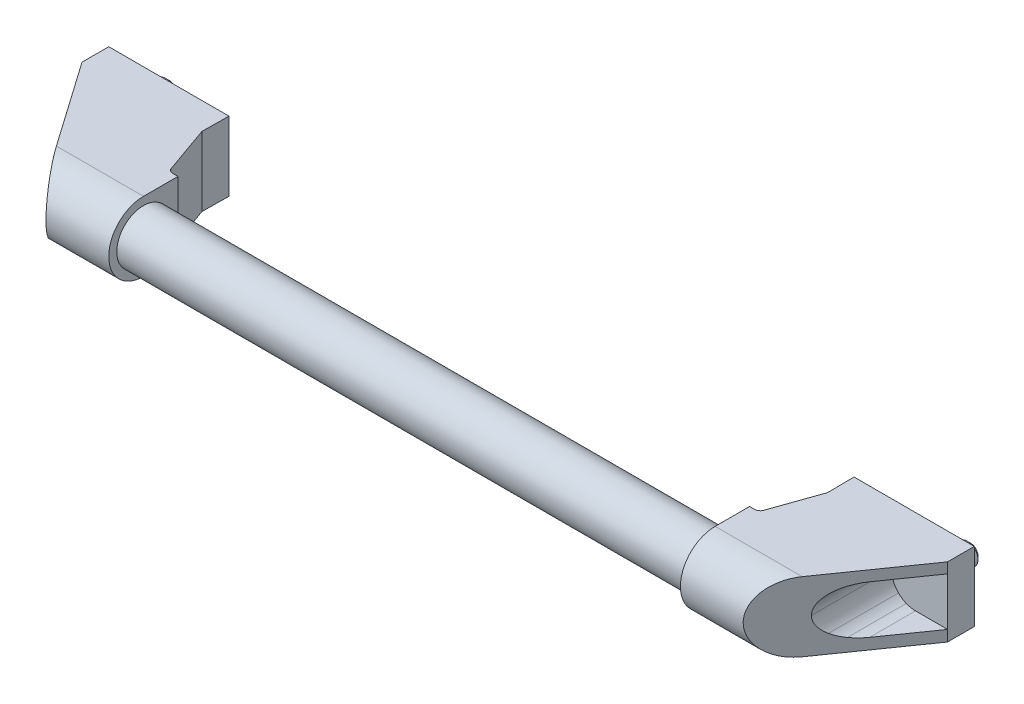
ISO-10303-21;
HEADER;
FILE_DESCRIPTION(('STEP AP214'),'2;1');
FILE_NAME('part.step','',(''),(''),'','','');
FILE_SCHEMA(('AUTOMOTIVE_DESIGN { 1 0 10303 214 1 1 1 1 }'));
ENDSEC;
DATA;
#1=APPLICATION_CONTEXT('core data for automotive mechanical design processes');
#2=APPLICATION_PROTOCOL_DEFINITION('international standard','automotive_design',2000,#1);
#3=PRODUCT_CONTEXT('',#1,'mechanical');
#4=PRODUCT('Part','Part','',(#3));
#5=PRODUCT_RELATED_PRODUCT_CATEGORY('part','',(#4));
#6=PRODUCT_DEFINITION_FORMATION('','',#4);
#7=PRODUCT_DEFINITION_CONTEXT('part definition',#1,'design');
#8=PRODUCT_DEFINITION('design','',#6,#7);
#9=PRODUCT_DEFINITION_SHAPE('','',#8);
#10=(LENGTH_UNIT() NAMED_UNIT(*) SI_UNIT(.MILLI.,.METRE.));
#11=(NAMED_UNIT(*) PLANE_ANGLE_UNIT() SI_UNIT($,.RADIAN.));
#12=(NAMED_UNIT(*) SI_UNIT($,.STERADIAN.) SOLID_ANGLE_UNIT());
#13=UNCERTAINTY_MEASURE_WITH_UNIT(LENGTH_MEASURE(1.E-05),#10,'distance_accuracy_value','');
#14=(GEOMETRIC_REPRESENTATION_CONTEXT(3) GLOBAL_UNCERTAINTY_ASSIGNED_CONTEXT((#13)) GLOBAL_UNIT_ASSIGNED_CONTEXT((#10,
#11,#12)) REPRESENTATION_CONTEXT('',''));
#15=CARTESIAN_POINT('',(0.,0.,0.));
#16=DIRECTION('',(0.,0.,1.));
#17=DIRECTION('',(1.,0.,0.));
#18=AXIS2_PLACEMENT_3D('',#15,#16,#17);
#19=CARTESIAN_POINT('',(-12.,13.,0.));
#20=DIRECTION('',(0.,0.,-1.));
#21=DIRECTION('',(1.,0.,0.));
#22=AXIS2_PLACEMENT_3D('',#19,#20,#21);
#23=PLANE('',#22);
#24=DIRECTION('',(0.,-1.,0.));
#25=VECTOR('',#24,1.);
#26=CARTESIAN_POINT('',(13.,8.,0.));
#27=LINE('',#26,#25);
#28=CARTESIAN_POINT('',(13.,8.,0.));
#29=VERTEX_POINT('',#28);
#30=CARTESIAN_POINT('',(13.,-8.,0.));
#31=VERTEX_POINT('',#30);
#32=EDGE_CURVE('E317',#29,#31,#27,.T.);
#33=ORIENTED_EDGE('',*,*,#32,.T.);
#34=DIRECTION('',(-1.,0.,0.));
#35=VECTOR('',#34,1.);
#36=CARTESIAN_POINT('',(28.,-8.,0.));
#37=LINE('',#36,#35);
#38=CARTESIAN_POINT('',(28.,-8.,0.));
#39=VERTEX_POINT('',#38);
#40=EDGE_CURVE('E304',#39,#31,#37,.T.);
#41=ORIENTED_EDGE('',*,*,#40,.F.);
#42=DIRECTION('',(0.,1.,0.));
#43=VECTOR('',#42,1.);
#44=CARTESIAN_POINT('',(28.,-8.,0.));
#45=LINE('',#44,#43);
#46=CARTESIAN_POINT('',(28.,8.,0.));
#47=VERTEX_POINT('',#46);
#48=EDGE_CURVE('E287',#39,#47,#45,.T.);
#49=ORIENTED_EDGE('',*,*,#48,.T.);
#50=DIRECTION('',(1.,0.,0.));
#51=VECTOR('',#50,1.);
#52=CARTESIAN_POINT('',(13.,8.,0.));
#53=LINE('',#52,#51);
#54=EDGE_CURVE('E301',#29,#47,#53,.T.);
#55=ORIENTED_EDGE('',*,*,#54,.F.);
#56=EDGE_LOOP('',(#33,#41,#49,#55));
#57=FACE_BOUND('',#56,.T.);
#58=DIRECTION('',(0.,1.,0.));
#59=VECTOR('',#58,1.);
#60=CARTESIAN_POINT('',(33.,-13.,0.));
#61=LINE('',#60,#59);
#62=CARTESIAN_POINT('',(33.,-13.,0.));
#63=VERTEX_POINT('',#62);
#64=CARTESIAN_POINT('',(33.,13.,0.));
#65=VERTEX_POINT('',#64);
#66=EDGE_CURVE('E410',#63,#65,#61,.T.);
#67=ORIENTED_EDGE('',*,*,#66,.F.);
#68=DIRECTION('',(1.,0.,0.));
#69=VECTOR('',#68,1.);
#70=CARTESIAN_POINT('',(-12.,-13.,0.));
#71=LINE('',#70,#69);
#72=CARTESIAN_POINT('',(-12.,-13.,0.));
#73=VERTEX_POINT('',#72);
#74=EDGE_CURVE('E444',#73,#63,#71,.T.);
#75=ORIENTED_EDGE('',*,*,#74,.F.);
#76=DIRECTION('',(0.,-1.,0.));
#77=VECTOR('',#76,1.);
#78=CARTESIAN_POINT('',(-12.,13.,0.));
#79=LINE('',#78,#77);
#80=CARTESIAN_POINT('',(-12.,13.,0.));
#81=VERTEX_POINT('',#80);
#82=EDGE_CURVE('E436',#81,#73,#79,.T.);
#83=ORIENTED_EDGE('',*,*,#82,.F.);
#84=DIRECTION('',(1.,0.,0.));
#85=VECTOR('',#84,1.);
#86=CARTESIAN_POINT('',(-12.,13.,0.));
#87=LINE('',#86,#85);
#88=EDGE_CURVE('E441',#81,#65,#87,.T.);
#89=ORIENTED_EDGE('',*,*,#88,.T.);
#90=EDGE_LOOP('',(#67,#75,#83,#89));
#91=FACE_BOUND('',#90,.T.);
#92=CARTESIAN_POINT('',(0.,0.,0.));
#93=DIRECTION('',(0.,0.,-1.));
#94=DIRECTION('',(-1.,0.,0.));
#95=AXIS2_PLACEMENT_3D('',#92,#93,#94);
#96=CIRCLE('',#95,4.);
#97=CARTESIAN_POINT('',(-4.,0.,0.));
#98=VERTEX_POINT('',#97);
#99=EDGE_CURVE('E1261',#98,#98,#96,.T.);
#100=ORIENTED_EDGE('',*,*,#99,.F.);
#101=EDGE_LOOP('',(#100));
#102=FACE_BOUND('',#101,.T.);
#103=ADVANCED_FACE('F14',(#57,#91,#102),#23,.T.);
#104=CARTESIAN_POINT('',(-12.,-13.,10.));
#105=DIRECTION('',(0.819152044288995,0.,-0.573576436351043));
#106=DIRECTION('',(0.573576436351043,0.,0.819152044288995));
#107=AXIS2_PLACEMENT_3D('',#104,#105,#106);
#108=PLANE('',#107);
#109=DIRECTION('',(-0.573576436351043,0.,-0.819152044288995));
#110=VECTOR('',#109,1.);
#111=CARTESIAN_POINT('',(-12.,-8.90119415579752,10.));
#112=LINE('',#111,#110);
#113=CARTESIAN_POINT('',(7.15225748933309E-06,-8.90119415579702,27.137786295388));
#114=VERTEX_POINT('',#113);
#115=CARTESIAN_POINT('',(-12.,-8.90119415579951,10.));
#116=VERTEX_POINT('',#115);
#117=EDGE_CURVE('E472',#114,#116,#112,.T.);
#118=ORIENTED_EDGE('',*,*,#117,.T.);
#119=DIRECTION('',(0.,1.,0.));
#120=VECTOR('',#119,1.);
#121=CARTESIAN_POINT('',(-12.,-13.,10.));
#122=LINE('',#121,#120);
#123=CARTESIAN_POINT('',(-12.,-13.,10.));
#124=VERTEX_POINT('',#123);
#125=EDGE_CURVE('E420',#124,#116,#122,.T.);
#126=ORIENTED_EDGE('',*,*,#125,.F.);
#127=DIRECTION('',(0.573576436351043,0.,0.819152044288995));
#128=VECTOR('',#127,1.);
#129=CARTESIAN_POINT('',(-12.,-13.,10.));
#130=LINE('',#129,#128);
#131=CARTESIAN_POINT('',(10.4066412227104,-13.,42.));
#132=VERTEX_POINT('',#131);
#133=EDGE_CURVE('E416',#124,#132,#130,.T.);
#134=ORIENTED_EDGE('',*,*,#133,.T.);
#135=CARTESIAN_POINT('',(10.4066412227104,0.,42.));
#136=DIRECTION('',(-0.819152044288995,0.,0.573576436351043));
#137=DIRECTION('',(0.573576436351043,0.,0.819152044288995));
#138=AXIS2_PLACEMENT_3D('',#135,#136,#137);
#139=ELLIPSE('',#138,15.8700696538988,13.);
#140=CARTESIAN_POINT('',(10.4066412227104,13.,42.));
#141=VERTEX_POINT('',#140);
#142=EDGE_CURVE('E423',#132,#141,#139,.T.);
#143=ORIENTED_EDGE('',*,*,#142,.T.);
#144=DIRECTION('',(0.573576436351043,0.,0.819152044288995));
#145=VECTOR('',#144,1.);
#146=CARTESIAN_POINT('',(-12.,13.,10.));
#147=LINE('',#146,#145);
#148=CARTESIAN_POINT('',(-12.,13.,10.));
#149=VERTEX_POINT('',#148);
#150=EDGE_CURVE('E413',#149,#141,#147,.T.);
#151=ORIENTED_EDGE('',*,*,#150,.F.);
#152=CARTESIAN_POINT('',(-12.,9.09880893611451,10.));
#153=VERTEX_POINT('',#152);
#154=EDGE_CURVE('E419',#153,#149,#122,.T.);
#155=ORIENTED_EDGE('',*,*,#154,.F.);
#156=DIRECTION('',(-0.573576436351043,0.,-0.819152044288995));
#157=VECTOR('',#156,1.);
#158=CARTESIAN_POINT('',(-12.,9.09880893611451,10.));
#159=LINE('',#158,#157);
#160=CARTESIAN_POINT('',(0.,9.09880893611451,27.1377760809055));
#161=VERTEX_POINT('',#160);
#162=EDGE_CURVE('E451',#161,#153,#159,.T.);
#163=ORIENTED_EDGE('',*,*,#162,.F.);
#164=CARTESIAN_POINT('',(-6.61501402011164E-06,0.098772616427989,27.1377666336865));
#165=DIRECTION('',(-0.819152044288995,0.,0.573576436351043));
#166=DIRECTION('',(0.573576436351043,0.,0.819152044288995));
#167=AXIS2_PLACEMENT_3D('',#164,#165,#166);
#168=ELLIPSE('',#167,15.691084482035,9.0000363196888);
#169=CARTESIAN_POINT('',(3.444151,8.4137249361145,32.0565334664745));
#170=VERTEX_POINT('',#169);
#171=EDGE_CURVE('E454',#170,#161,#168,.T.);
#172=ORIENTED_EDGE('',*,*,#171,.F.);
#173=CARTESIAN_POINT('',(-2.10368270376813E-05,0.0987787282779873,27.137746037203));
#174=DIRECTION('',(-0.819152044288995,0.,0.573576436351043));
#175=DIRECTION('',(0.573576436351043,0.,0.819152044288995));
#176=AXIS2_PLACEMENT_3D('',#173,#174,#175);
#177=ELLIPSE('',#176,15.6910842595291,9.00003619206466);
#178=CARTESIAN_POINT('',(6.36396099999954,6.4627699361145,36.22645429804));
#179=VERTEX_POINT('',#178);
#180=EDGE_CURVE('E457',#179,#170,#177,.T.);
#181=ORIENTED_EDGE('',*,*,#180,.F.);
#182=CARTESIAN_POINT('',(-3.07078365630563E-05,0.098790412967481,27.13773222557));
#183=DIRECTION('',(-0.819152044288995,0.,0.573576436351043));
#184=DIRECTION('',(0.573576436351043,0.,0.819152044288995));
#185=AXIS2_PLACEMENT_3D('',#182,#183,#184);
#186=ELLIPSE('',#185,15.6910817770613,9.00003476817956);
#187=CARTESIAN_POINT('',(9.00000406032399,0.0988089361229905,39.9911139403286));
#188=VERTEX_POINT('',#187);
#189=EDGE_CURVE('E460',#188,#179,#186,.T.);
#190=ORIENTED_EDGE('',*,*,#189,.F.);
#191=CARTESIAN_POINT('',(-3.27593625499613E-05,0.0988180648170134,27.1377292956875));
#192=DIRECTION('',(-0.819152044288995,0.,0.573576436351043));
#193=DIRECTION('',(0.573576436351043,0.,0.819152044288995));
#194=AXIS2_PLACEMENT_3D('',#191,#192,#193);
#195=ELLIPSE('',#194,15.6910853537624,9.00003681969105);
#196=CARTESIAN_POINT('',(6.36396815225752,-6.26515515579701,36.2264645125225));
#197=VERTEX_POINT('',#196);
#198=EDGE_CURVE('E463',#197,#188,#195,.T.);
#199=ORIENTED_EDGE('',*,*,#198,.F.);
#200=CARTESIAN_POINT('',(-1.38845694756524E-05,0.0988360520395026,27.1377562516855));
#201=DIRECTION('',(-0.819152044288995,0.,0.573576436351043));
#202=DIRECTION('',(0.573576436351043,0.,0.819152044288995));
#203=AXIS2_PLACEMENT_3D('',#200,#201,#202);
#204=ELLIPSE('',#203,15.6910842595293,9.00003619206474);
#205=CARTESIAN_POINT('',(3.44415815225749,-8.21611015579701,32.0565436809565));
#206=VERTEX_POINT('',#205);
#207=EDGE_CURVE('E466',#206,#197,#204,.T.);
#208=ORIENTED_EDGE('',*,*,#207,.F.);
#209=CARTESIAN_POINT('',(5.37242991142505E-07,0.0988421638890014,27.1377768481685));
#210=DIRECTION('',(-0.819152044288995,0.,0.573576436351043));
#211=DIRECTION('',(0.573576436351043,0.,0.819152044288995));
#212=AXIS2_PLACEMENT_3D('',#209,#210,#211);
#213=ELLIPSE('',#212,15.6910844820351,9.00003631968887);
#214=EDGE_CURVE('E469',#114,#206,#213,.T.);
#215=ORIENTED_EDGE('',*,*,#214,.F.);
#216=EDGE_LOOP('',(#118,#126,#134,#143,#151,#155,#163,#172,#181,#190,#199,#208,#215));
#217=FACE_BOUND('',#216,.T.);
#218=ADVANCED_FACE('F726',(#217),#108,.F.);
#219=CARTESIAN_POINT('',(-12.,13.,42.));
#220=DIRECTION('',(0.,1.,0.));
#221=DIRECTION('',(1.,0.,0.));
#222=AXIS2_PLACEMENT_3D('',#219,#220,#221);
#223=PLANE('',#222);
#224=DIRECTION('',(0.0104830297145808,0.,-0.999945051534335));
#225=VECTOR('',#224,1.);
#226=CARTESIAN_POINT('',(32.8951697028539,13.,9.99945051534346));
#227=LINE('',#226,#225);
#228=CARTESIAN_POINT('',(32.8951697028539,13.,9.99945051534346));
#229=VERTEX_POINT('',#228);
#230=EDGE_CURVE('E388',#229,#65,#227,.T.);
#231=ORIENTED_EDGE('',*,*,#230,.T.);
#232=ORIENTED_EDGE('',*,*,#88,.F.);
#233=DIRECTION('',(0.,0.,-1.));
#234=VECTOR('',#233,1.);
#235=CARTESIAN_POINT('',(-12.,13.,42.));
#236=LINE('',#235,#234);
#237=EDGE_CURVE('E434',#149,#81,#236,.T.);
#238=ORIENTED_EDGE('',*,*,#237,.F.);
#239=ORIENTED_EDGE('',*,*,#150,.T.);
#240=DIRECTION('',(1.,0.,0.));
#241=VECTOR('',#240,1.);
#242=CARTESIAN_POINT('',(-12.,13.,42.));
#243=LINE('',#242,#241);
#244=CARTESIAN_POINT('',(43.,13.,42.));
#245=VERTEX_POINT('',#244);
#246=EDGE_CURVE('E449',#141,#245,#243,.T.);
#247=ORIENTED_EDGE('',*,*,#246,.T.);
#248=DIRECTION('',(0.,0.,-1.));
#249=VECTOR('',#248,1.);
#250=CARTESIAN_POINT('',(43.,13.,42.));
#251=LINE('',#250,#249);
#252=CARTESIAN_POINT('',(43.,13.,29.106429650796));
#253=VERTEX_POINT('',#252);
#254=EDGE_CURVE('E425',#245,#253,#251,.T.);
#255=ORIENTED_EDGE('',*,*,#254,.T.);
#256=DIRECTION('',(-0.999945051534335,0.,-0.0104830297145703));
#257=VECTOR('',#256,1.);
#258=CARTESIAN_POINT('',(43.,13.,29.106429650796));
#259=LINE('',#258,#257);
#260=CARTESIAN_POINT('',(41.0113841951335,13.,29.0855817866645));
#261=VERTEX_POINT('',#260);
#262=EDGE_CURVE('E379',#253,#261,#259,.T.);
#263=ORIENTED_EDGE('',*,*,#262,.T.);
#264=CARTESIAN_POINT('',(41.0323502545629,13.,27.085691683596));
#265=DIRECTION('',(0.,-1.,0.));
#266=DIRECTION('',(1.,0.,0.));
#267=AXIS2_PLACEMENT_3D('',#264,#265,#266);
#268=CIRCLE('',#267,2.);
#269=CARTESIAN_POINT('',(39.1458974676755,13.,27.7499927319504));
#270=VERTEX_POINT('',#269);
#271=EDGE_CURVE('E382',#261,#270,#268,.T.);
#272=ORIENTED_EDGE('',*,*,#271,.T.);
#273=DIRECTION('',(0.332150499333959,0.,0.943226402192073));
#274=VECTOR('',#273,1.);
#275=CARTESIAN_POINT('',(32.8951697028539,13.,9.99945051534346));
#276=LINE('',#275,#274);
#277=EDGE_CURVE('E385',#229,#270,#276,.T.);
#278=ORIENTED_EDGE('',*,*,#277,.F.);
#279=EDGE_LOOP('',(#231,#232,#238,#239,#247,#255,#263,#272,#278));
#280=FACE_BOUND('',#279,.T.);
#281=ADVANCED_FACE('F732',(#280),#223,.T.);
#282=CARTESIAN_POINT('',(-12.,0.,42.));
#283=DIRECTION('',(1.,0.,0.));
#284=DIRECTION('',(0.,-1.,0.));
#285=AXIS2_PLACEMENT_3D('',#282,#283,#284);
#286=CYLINDRICAL_SURFACE('',#285,13.);
#287=ORIENTED_EDGE('',*,*,#142,.F.);
#288=DIRECTION('',(1.,0.,0.));
#289=VECTOR('',#288,1.);
#290=CARTESIAN_POINT('',(-12.,-13.,42.));
#291=LINE('',#290,#289);
#292=CARTESIAN_POINT('',(43.,-13.,42.));
#293=VERTEX_POINT('',#292);
#294=EDGE_CURVE('E447',#132,#293,#291,.T.);
#295=ORIENTED_EDGE('',*,*,#294,.T.);
#296=CARTESIAN_POINT('',(43.,0.,42.));
#297=DIRECTION('',(1.,0.,0.));
#298=DIRECTION('',(0.,1.,0.));
#299=AXIS2_PLACEMENT_3D('',#296,#297,#298);
#300=CIRCLE('',#299,13.);
#301=EDGE_CURVE('E431',#245,#293,#300,.T.);
#302=ORIENTED_EDGE('',*,*,#301,.F.);
#303=ORIENTED_EDGE('',*,*,#246,.F.);
#304=EDGE_LOOP('',(#287,#295,#302,#303));
#305=FACE_BOUND('',#304,.T.);
#306=ADVANCED_FACE('F742',(#305),#286,.T.);
#307=CARTESIAN_POINT('',(-12.,-13.,42.));
#308=DIRECTION('',(0.,1.,0.));
#309=DIRECTION('',(1.,0.,0.));
#310=AXIS2_PLACEMENT_3D('',#307,#308,#309);
#311=PLANE('',#310);
#312=DIRECTION('',(0.332150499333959,0.,0.943226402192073));
#313=VECTOR('',#312,1.);
#314=CARTESIAN_POINT('',(32.8951697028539,-13.,9.99945051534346));
#315=LINE('',#314,#313);
#316=CARTESIAN_POINT('',(32.8951697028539,-13.,9.99945051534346));
#317=VERTEX_POINT('',#316);
#318=CARTESIAN_POINT('',(39.1458974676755,-13.,27.7499927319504));
#319=VERTEX_POINT('',#318);
#320=EDGE_CURVE('E396',#317,#319,#315,.T.);
#321=ORIENTED_EDGE('',*,*,#320,.T.);
#322=CARTESIAN_POINT('',(41.0323502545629,-13.,27.085691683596));
#323=DIRECTION('',(0.,-1.,0.));
#324=DIRECTION('',(1.,0.,0.));
#325=AXIS2_PLACEMENT_3D('',#322,#323,#324);
#326=CIRCLE('',#325,2.);
#327=CARTESIAN_POINT('',(41.0113841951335,-13.,29.0855817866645));
#328=VERTEX_POINT('',#327);
#329=EDGE_CURVE('E393',#328,#319,#326,.T.);
#330=ORIENTED_EDGE('',*,*,#329,.F.);
#331=DIRECTION('',(-0.999945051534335,0.,-0.0104830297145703));
#332=VECTOR('',#331,1.);
#333=CARTESIAN_POINT('',(43.,-13.,29.106429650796));
#334=LINE('',#333,#332);
#335=CARTESIAN_POINT('',(43.,-13.,29.106429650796));
#336=VERTEX_POINT('',#335);
#337=EDGE_CURVE('E390',#336,#328,#334,.T.);
#338=ORIENTED_EDGE('',*,*,#337,.F.);
#339=DIRECTION('',(0.,0.,-1.));
#340=VECTOR('',#339,1.);
#341=CARTESIAN_POINT('',(43.,-13.,42.));
#342=LINE('',#341,#340);
#343=EDGE_CURVE('E428',#293,#336,#342,.T.);
#344=ORIENTED_EDGE('',*,*,#343,.F.);
#345=ORIENTED_EDGE('',*,*,#294,.F.);
#346=ORIENTED_EDGE('',*,*,#133,.F.);
#347=DIRECTION('',(0.,0.,-1.));
#348=VECTOR('',#347,1.);
#349=CARTESIAN_POINT('',(-12.,-13.,42.));
#350=LINE('',#349,#348);
#351=EDGE_CURVE('E439',#124,#73,#350,.T.);
#352=ORIENTED_EDGE('',*,*,#351,.T.);
#353=ORIENTED_EDGE('',*,*,#74,.T.);
#354=DIRECTION('',(0.0104830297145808,0.,-0.999945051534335));
#355=VECTOR('',#354,1.);
#356=CARTESIAN_POINT('',(32.8951697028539,-13.,9.99945051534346));
#357=LINE('',#356,#355);
#358=EDGE_CURVE('E399',#317,#63,#357,.T.);
#359=ORIENTED_EDGE('',*,*,#358,.F.);
#360=EDGE_LOOP('',(#321,#330,#338,#344,#345,#346,#352,#353,#359));
#361=FACE_BOUND('',#360,.T.);
#362=ADVANCED_FACE('F738',(#361),#311,.F.);
#363=CARTESIAN_POINT('',(-12.,0.,42.));
#364=DIRECTION('',(-1.,0.,0.));
#365=DIRECTION('',(0.,1.,0.));
#366=AXIS2_PLACEMENT_3D('',#363,#364,#365);
#367=PLANE('',#366);
#368=ORIENTED_EDGE('',*,*,#125,.T.);
#369=DIRECTION('',(0.,1.,0.));
#370=VECTOR('',#369,1.);
#371=CARTESIAN_POINT('',(-12.,-8.90119415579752,10.));
#372=LINE('',#371,#370);
#373=EDGE_CURVE('E355',#116,#153,#372,.T.);
#374=ORIENTED_EDGE('',*,*,#373,.T.);
#375=ORIENTED_EDGE('',*,*,#154,.T.);
#376=ORIENTED_EDGE('',*,*,#237,.T.);
#377=ORIENTED_EDGE('',*,*,#82,.T.);
#378=ORIENTED_EDGE('',*,*,#351,.F.);
#379=EDGE_LOOP('',(#368,#374,#375,#376,#377,#378));
#380=FACE_BOUND('',#379,.T.);
#381=ADVANCED_FACE('F741',(#380),#367,.T.);
#382=CARTESIAN_POINT('',(43.,0.,42.));
#383=DIRECTION('',(-1.,0.,0.));
#384=DIRECTION('',(0.,1.,0.));
#385=AXIS2_PLACEMENT_3D('',#382,#383,#384);
#386=PLANE('',#385);
#387=DIRECTION('',(0.,1.,0.));
#388=VECTOR('',#387,1.);
#389=CARTESIAN_POINT('',(43.,-13.,29.106429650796));
#390=LINE('',#389,#388);
#391=EDGE_CURVE('E402',#336,#253,#390,.T.);
#392=ORIENTED_EDGE('',*,*,#391,.T.);
#393=ORIENTED_EDGE('',*,*,#254,.F.);
#394=ORIENTED_EDGE('',*,*,#301,.T.);
#395=ORIENTED_EDGE('',*,*,#343,.T.);
#396=EDGE_LOOP('',(#392,#393,#394,#395));
#397=FACE_BOUND('',#396,.T.);
#398=CARTESIAN_POINT('',(43.,0.,42.));
#399=DIRECTION('',(-1.,0.,0.));
#400=DIRECTION('',(0.,0.,1.));
#401=AXIS2_PLACEMENT_3D('',#398,#399,#400);
#402=CIRCLE('',#401,10.);
#403=CARTESIAN_POINT('',(43.,0.,52.));
#404=VERTEX_POINT('',#403);
#405=EDGE_CURVE('E1257',#404,#404,#402,.T.);
#406=ORIENTED_EDGE('',*,*,#405,.T.);
#407=EDGE_LOOP('',(#406));
#408=FACE_BOUND('',#407,.T.);
#409=ADVANCED_FACE('F1200',(#397,#408),#386,.F.);
#410=CARTESIAN_POINT('',(32.8951697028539,-13.,9.99945051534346));
#411=DIRECTION('',(-0.999945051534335,0.,-0.0104830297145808));
#412=DIRECTION('',(0.0104830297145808,0.,-0.999945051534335));
#413=AXIS2_PLACEMENT_3D('',#410,#411,#412);
#414=PLANE('',#413);
#415=DIRECTION('',(0.,1.,0.));
#416=VECTOR('',#415,1.);
#417=CARTESIAN_POINT('',(32.8951697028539,-13.,9.99945051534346));
#418=LINE('',#417,#416);
#419=EDGE_CURVE('E408',#317,#229,#418,.T.);
#420=ORIENTED_EDGE('',*,*,#419,.F.);
#421=ORIENTED_EDGE('',*,*,#358,.T.);
#422=ORIENTED_EDGE('',*,*,#66,.T.);
#423=ORIENTED_EDGE('',*,*,#230,.F.);
#424=EDGE_LOOP('',(#420,#421,#422,#423));
#425=FACE_BOUND('',#424,.T.);
#426=ADVANCED_FACE('F1191',(#425),#414,.F.);
#427=CARTESIAN_POINT('',(32.8951697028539,-13.,9.99945051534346));
#428=DIRECTION('',(0.943226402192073,0.,-0.332150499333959));
#429=DIRECTION('',(0.332150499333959,0.,0.943226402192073));
#430=AXIS2_PLACEMENT_3D('',#427,#428,#429);
#431=PLANE('',#430);
#432=DIRECTION('',(0.,1.,0.));
#433=VECTOR('',#432,1.);
#434=CARTESIAN_POINT('',(39.1458974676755,-13.,27.7499927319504));
#435=LINE('',#434,#433);
#436=EDGE_CURVE('E406',#319,#270,#435,.T.);
#437=ORIENTED_EDGE('',*,*,#436,.F.);
#438=ORIENTED_EDGE('',*,*,#320,.F.);
#439=ORIENTED_EDGE('',*,*,#419,.T.);
#440=ORIENTED_EDGE('',*,*,#277,.T.);
#441=EDGE_LOOP('',(#437,#438,#439,#440));
#442=FACE_BOUND('',#441,.T.);
#443=ADVANCED_FACE('F1182',(#442),#431,.T.);
#444=CARTESIAN_POINT('',(41.0323502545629,-13.,27.085691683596));
#445=DIRECTION('',(0.,1.,0.));
#446=DIRECTION('',(1.,0.,0.));
#447=AXIS2_PLACEMENT_3D('',#444,#445,#446);
#448=CYLINDRICAL_SURFACE('',#447,2.);
#449=DIRECTION('',(0.,1.,0.));
#450=VECTOR('',#449,1.);
#451=CARTESIAN_POINT('',(41.0113841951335,-13.,29.0855817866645));
#452=LINE('',#451,#450);
#453=EDGE_CURVE('E404',#328,#261,#452,.T.);
#454=ORIENTED_EDGE('',*,*,#453,.F.);
#455=ORIENTED_EDGE('',*,*,#329,.T.);
#456=ORIENTED_EDGE('',*,*,#436,.T.);
#457=ORIENTED_EDGE('',*,*,#271,.F.);
#458=EDGE_LOOP('',(#454,#455,#456,#457));
#459=FACE_BOUND('',#458,.T.);
#460=ADVANCED_FACE('F1173',(#459),#448,.F.);
#461=CARTESIAN_POINT('',(43.,-13.,29.106429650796));
#462=DIRECTION('',(-0.0104830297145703,0.,0.999945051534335));
#463=DIRECTION('',(-0.999945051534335,0.,-0.0104830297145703));
#464=AXIS2_PLACEMENT_3D('',#461,#462,#463);
#465=PLANE('',#464);
#466=ORIENTED_EDGE('',*,*,#391,.F.);
#467=ORIENTED_EDGE('',*,*,#337,.T.);
#468=ORIENTED_EDGE('',*,*,#453,.T.);
#469=ORIENTED_EDGE('',*,*,#262,.F.);
#470=EDGE_LOOP('',(#466,#467,#468,#469));
#471=FACE_BOUND('',#470,.T.);
#472=ADVANCED_FACE('F1164',(#471),#465,.F.);
#473=CARTESIAN_POINT('',(-12.,-8.90119415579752,10.));
#474=DIRECTION('',(0.,1.,0.));
#475=DIRECTION('',(1.,0.,0.));
#476=AXIS2_PLACEMENT_3D('',#473,#474,#475);
#477=PLANE('',#476);
#478=ORIENTED_EDGE('',*,*,#117,.F.);
#479=DIRECTION('',(0.,0.,1.));
#480=VECTOR('',#479,1.);
#481=CARTESIAN_POINT('',(7.15225747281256E-06,-8.90119415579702,10.));
#482=LINE('',#481,#480);
#483=CARTESIAN_POINT('',(7.15225747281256E-06,-8.90119415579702,10.));
#484=VERTEX_POINT('',#483);
#485=EDGE_CURVE('E376',#484,#114,#482,.T.);
#486=ORIENTED_EDGE('',*,*,#485,.F.);
#487=DIRECTION('',(1.,0.,0.));
#488=VECTOR('',#487,1.);
#489=CARTESIAN_POINT('',(-12.,-8.90119415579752,10.));
#490=LINE('',#489,#488);
#491=EDGE_CURVE('E294',#116,#484,#490,.T.);
#492=ORIENTED_EDGE('',*,*,#491,.F.);
#493=EDGE_LOOP('',(#478,#486,#492));
#494=FACE_BOUND('',#493,.T.);
#495=ADVANCED_FACE('F1155',(#494),#477,.T.);
#496=CARTESIAN_POINT('',(5.37242994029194E-07,0.0988421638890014,10.));
#497=DIRECTION('',(0.,0.,1.));
#498=DIRECTION('',(-1.,0.,0.));
#499=AXIS2_PLACEMENT_3D('',#496,#497,#498);
#500=CYLINDRICAL_SURFACE('',#499,9.00003631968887);
#501=ORIENTED_EDGE('',*,*,#485,.T.);
#502=ORIENTED_EDGE('',*,*,#214,.T.);
#503=DIRECTION('',(0.,0.,1.));
#504=VECTOR('',#503,1.);
#505=CARTESIAN_POINT('',(3.44415815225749,-8.21611015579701,10.));
#506=LINE('',#505,#504);
#507=CARTESIAN_POINT('',(3.44415815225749,-8.21611015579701,10.));
#508=VERTEX_POINT('',#507);
#509=EDGE_CURVE('E373',#508,#206,#506,.T.);
#510=ORIENTED_EDGE('',*,*,#509,.F.);
#511=CARTESIAN_POINT('',(5.37242994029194E-07,0.0988421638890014,10.));
#512=DIRECTION('',(0.,0.,-1.));
#513=DIRECTION('',(-1.,0.,0.));
#514=AXIS2_PLACEMENT_3D('',#511,#512,#513);
#515=CIRCLE('',#514,9.00003631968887);
#516=EDGE_CURVE('E334',#508,#484,#515,.T.);
#517=ORIENTED_EDGE('',*,*,#516,.T.);
#518=EDGE_LOOP('',(#501,#502,#510,#517));
#519=FACE_BOUND('',#518,.T.);
#520=ADVANCED_FACE('F1146',(#519),#500,.F.);
#521=CARTESIAN_POINT('',(-1.38845695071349E-05,0.0988360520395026,10.));
#522=DIRECTION('',(0.,0.,1.));
#523=DIRECTION('',(-1.,0.,0.));
#524=AXIS2_PLACEMENT_3D('',#521,#522,#523);
#525=CYLINDRICAL_SURFACE('',#524,9.00003619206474);
#526=ORIENTED_EDGE('',*,*,#509,.T.);
#527=ORIENTED_EDGE('',*,*,#207,.T.);
#528=DIRECTION('',(0.,0.,1.));
#529=VECTOR('',#528,1.);
#530=CARTESIAN_POINT('',(6.36396815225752,-6.26515515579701,10.));
#531=LINE('',#530,#529);
#532=CARTESIAN_POINT('',(6.36396815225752,-6.26515515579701,10.));
#533=VERTEX_POINT('',#532);
#534=EDGE_CURVE('E370',#533,#197,#531,.T.);
#535=ORIENTED_EDGE('',*,*,#534,.F.);
#536=CARTESIAN_POINT('',(-1.38845695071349E-05,0.0988360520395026,10.));
#537=DIRECTION('',(0.,0.,-1.));
#538=DIRECTION('',(-1.,0.,0.));
#539=AXIS2_PLACEMENT_3D('',#536,#537,#538);
#540=CIRCLE('',#539,9.00003619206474);
#541=EDGE_CURVE('E337',#533,#508,#540,.T.);
#542=ORIENTED_EDGE('',*,*,#541,.T.);
#543=EDGE_LOOP('',(#526,#527,#535,#542));
#544=FACE_BOUND('',#543,.T.);
#545=ADVANCED_FACE('F1137',(#544),#525,.F.);
#546=CARTESIAN_POINT('',(-3.27593625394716E-05,0.0988180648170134,10.));
#547=DIRECTION('',(0.,0.,1.));
#548=DIRECTION('',(-1.,0.,0.));
#549=AXIS2_PLACEMENT_3D('',#546,#547,#548);
#550=CYLINDRICAL_SURFACE('',#549,9.00003681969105);
#551=ORIENTED_EDGE('',*,*,#534,.T.);
#552=ORIENTED_EDGE('',*,*,#198,.T.);
#553=DIRECTION('',(0.,0.,1.));
#554=VECTOR('',#553,1.);
#555=CARTESIAN_POINT('',(9.00000406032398,0.0988089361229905,10.));
#556=LINE('',#555,#554);
#557=CARTESIAN_POINT('',(9.00000406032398,0.0988089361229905,10.));
#558=VERTEX_POINT('',#557);
#559=EDGE_CURVE('E367',#558,#188,#556,.T.);
#560=ORIENTED_EDGE('',*,*,#559,.F.);
#561=CARTESIAN_POINT('',(-3.27593625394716E-05,0.0988180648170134,10.));
#562=DIRECTION('',(0.,0.,-1.));
#563=DIRECTION('',(-1.,0.,0.));
#564=AXIS2_PLACEMENT_3D('',#561,#562,#563);
#565=CIRCLE('',#564,9.00003681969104);
#566=EDGE_CURVE('E340',#558,#533,#565,.T.);
#567=ORIENTED_EDGE('',*,*,#566,.T.);
#568=EDGE_LOOP('',(#551,#552,#560,#567));
#569=FACE_BOUND('',#568,.T.);
#570=ADVANCED_FACE('F1128',(#569),#550,.F.);
#571=CARTESIAN_POINT('',(-3.07078365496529E-05,0.098790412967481,10.));
#572=DIRECTION('',(0.,0.,1.));
#573=DIRECTION('',(-1.,0.,0.));
#574=AXIS2_PLACEMENT_3D('',#571,#572,#573);
#575=CYLINDRICAL_SURFACE('',#574,9.00003476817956);
#576=ORIENTED_EDGE('',*,*,#559,.T.);
#577=ORIENTED_EDGE('',*,*,#189,.T.);
#578=DIRECTION('',(0.,0.,1.));
#579=VECTOR('',#578,1.);
#580=CARTESIAN_POINT('',(6.36396099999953,6.4627699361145,10.));
#581=LINE('',#580,#579);
#582=CARTESIAN_POINT('',(6.36396099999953,6.4627699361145,10.));
#583=VERTEX_POINT('',#582);
#584=EDGE_CURVE('E364',#583,#179,#581,.T.);
#585=ORIENTED_EDGE('',*,*,#584,.F.);
#586=CARTESIAN_POINT('',(-3.07078365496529E-05,0.098790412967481,10.));
#587=DIRECTION('',(0.,0.,-1.));
#588=DIRECTION('',(-1.,0.,0.));
#589=AXIS2_PLACEMENT_3D('',#586,#587,#588);
#590=CIRCLE('',#589,9.00003476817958);
#591=EDGE_CURVE('E343',#583,#558,#590,.T.);
#592=ORIENTED_EDGE('',*,*,#591,.T.);
#593=EDGE_LOOP('',(#576,#577,#585,#592));
#594=FACE_BOUND('',#593,.T.);
#595=ADVANCED_FACE('F1119',(#594),#575,.F.);
#596=CARTESIAN_POINT('',(-2.1036827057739E-05,0.0987787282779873,10.));
#597=DIRECTION('',(0.,0.,1.));
#598=DIRECTION('',(-1.,0.,0.));
#599=AXIS2_PLACEMENT_3D('',#596,#597,#598);
#600=CYLINDRICAL_SURFACE('',#599,9.00003619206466);
#601=ORIENTED_EDGE('',*,*,#584,.T.);
#602=ORIENTED_EDGE('',*,*,#180,.T.);
#603=DIRECTION('',(0.,0.,1.));
#604=VECTOR('',#603,1.);
#605=CARTESIAN_POINT('',(3.444151,8.4137249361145,10.));
#606=LINE('',#605,#604);
#607=CARTESIAN_POINT('',(3.444151,8.4137249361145,10.));
#608=VERTEX_POINT('',#607);
#609=EDGE_CURVE('E361',#608,#170,#606,.T.);
#610=ORIENTED_EDGE('',*,*,#609,.F.);
#611=CARTESIAN_POINT('',(-2.1036827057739E-05,0.0987787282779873,10.));
#612=DIRECTION('',(0.,0.,-1.));
#613=DIRECTION('',(-1.,0.,0.));
#614=AXIS2_PLACEMENT_3D('',#611,#612,#613);
#615=CIRCLE('',#614,9.00003619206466);
#616=EDGE_CURVE('E346',#608,#583,#615,.T.);
#617=ORIENTED_EDGE('',*,*,#616,.T.);
#618=EDGE_LOOP('',(#601,#602,#610,#617));
#619=FACE_BOUND('',#618,.T.);
#620=ADVANCED_FACE('F1110',(#619),#600,.F.);
#621=CARTESIAN_POINT('',(-6.61501400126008E-06,0.098772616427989,10.));
#622=DIRECTION('',(0.,0.,1.));
#623=DIRECTION('',(-1.,0.,0.));
#624=AXIS2_PLACEMENT_3D('',#621,#622,#623);
#625=CYLINDRICAL_SURFACE('',#624,9.0000363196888);
#626=ORIENTED_EDGE('',*,*,#609,.T.);
#627=ORIENTED_EDGE('',*,*,#171,.T.);
#628=DIRECTION('',(0.,0.,1.));
#629=VECTOR('',#628,1.);
#630=CARTESIAN_POINT('',(0.,9.09880893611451,10.));
#631=LINE('',#630,#629);
#632=CARTESIAN_POINT('',(0.,9.09880893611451,10.));
#633=VERTEX_POINT('',#632);
#634=EDGE_CURVE('E358',#633,#161,#631,.T.);
#635=ORIENTED_EDGE('',*,*,#634,.F.);
#636=CARTESIAN_POINT('',(-6.61501400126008E-06,0.098772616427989,10.));
#637=DIRECTION('',(0.,0.,-1.));
#638=DIRECTION('',(-1.,0.,0.));
#639=AXIS2_PLACEMENT_3D('',#636,#637,#638);
#640=CIRCLE('',#639,9.0000363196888);
#641=EDGE_CURVE('E349',#633,#608,#640,.T.);
#642=ORIENTED_EDGE('',*,*,#641,.T.);
#643=EDGE_LOOP('',(#626,#627,#635,#642));
#644=FACE_BOUND('',#643,.T.);
#645=ADVANCED_FACE('F1101',(#644),#625,.F.);
#646=CARTESIAN_POINT('',(-12.,9.09880893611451,10.));
#647=DIRECTION('',(0.,1.,0.));
#648=DIRECTION('',(1.,0.,0.));
#649=AXIS2_PLACEMENT_3D('',#646,#647,#648);
#650=PLANE('',#649);
#651=ORIENTED_EDGE('',*,*,#634,.T.);
#652=ORIENTED_EDGE('',*,*,#162,.T.);
#653=DIRECTION('',(1.,0.,0.));
#654=VECTOR('',#653,1.);
#655=CARTESIAN_POINT('',(-12.,9.09880893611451,10.));
#656=LINE('',#655,#654);
#657=EDGE_CURVE('E352',#153,#633,#656,.T.);
#658=ORIENTED_EDGE('',*,*,#657,.T.);
#659=EDGE_LOOP('',(#651,#652,#658));
#660=FACE_BOUND('',#659,.T.);
#661=ADVANCED_FACE('F1092',(#660),#650,.F.);
#662=CARTESIAN_POINT('',(5.37242994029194E-07,0.0988421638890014,10.));
#663=DIRECTION('',(0.,0.,1.));
#664=DIRECTION('',(-1.,0.,0.));
#665=AXIS2_PLACEMENT_3D('',#662,#663,#664);
#666=PLANE('',#665);
#667=ORIENTED_EDGE('',*,*,#491,.T.);
#668=ORIENTED_EDGE('',*,*,#516,.F.);
#669=ORIENTED_EDGE('',*,*,#541,.F.);
#670=ORIENTED_EDGE('',*,*,#566,.F.);
#671=ORIENTED_EDGE('',*,*,#591,.F.);
#672=ORIENTED_EDGE('',*,*,#616,.F.);
#673=ORIENTED_EDGE('',*,*,#641,.F.);
#674=ORIENTED_EDGE('',*,*,#657,.F.);
#675=ORIENTED_EDGE('',*,*,#373,.F.);
#676=EDGE_LOOP('',(#667,#668,#669,#670,#671,#672,#673,#674,#675));
#677=FACE_BOUND('',#676,.T.);
#678=ADVANCED_FACE('F1084',(#677),#666,.T.);
#679=CARTESIAN_POINT('',(13.,8.,30.));
#680=DIRECTION('',(0.,-1.,0.));
#681=DIRECTION('',(-1.,0.,0.));
#682=AXIS2_PLACEMENT_3D('',#679,#680,#681);
#683=PLANE('',#682);
#684=DIRECTION('',(0.,0.,-1.));
#685=VECTOR('',#684,1.);
#686=CARTESIAN_POINT('',(28.,8.,30.));
#687=LINE('',#686,#685);
#688=CARTESIAN_POINT('',(28.,8.,30.));
#689=VERTEX_POINT('',#688);
#690=EDGE_CURVE('E284',#689,#47,#687,.T.);
#691=ORIENTED_EDGE('',*,*,#690,.F.);
#692=DIRECTION('',(1.,0.,0.));
#693=VECTOR('',#692,1.);
#694=CARTESIAN_POINT('',(13.,8.,30.));
#695=LINE('',#694,#693);
#696=CARTESIAN_POINT('',(13.,8.,30.));
#697=VERTEX_POINT('',#696);
#698=EDGE_CURVE('E319',#697,#689,#695,.T.);
#699=ORIENTED_EDGE('',*,*,#698,.F.);
#700=DIRECTION('',(0.,0.,-1.));
#701=VECTOR('',#700,1.);
#702=CARTESIAN_POINT('',(13.,8.,30.));
#703=LINE('',#702,#701);
#704=EDGE_CURVE('E307',#697,#29,#703,.T.);
#705=ORIENTED_EDGE('',*,*,#704,.T.);
#706=ORIENTED_EDGE('',*,*,#54,.T.);
#707=EDGE_LOOP('',(#691,#699,#705,#706));
#708=FACE_BOUND('',#707,.T.);
#709=ADVANCED_FACE('F306',(#708),#683,.T.);
#710=CARTESIAN_POINT('',(28.,-8.,30.));
#711=DIRECTION('',(1.,0.,0.));
#712=DIRECTION('',(0.,-1.,0.));
#713=AXIS2_PLACEMENT_3D('',#710,#711,#712);
#714=PLANE('',#713);
#715=DIRECTION('',(0.,0.,-1.));
#716=VECTOR('',#715,1.);
#717=CARTESIAN_POINT('',(28.,-8.,30.));
#718=LINE('',#717,#716);
#719=CARTESIAN_POINT('',(28.,-8.,30.));
#720=VERTEX_POINT('',#719);
#721=EDGE_CURVE('E295',#720,#39,#718,.T.);
#722=ORIENTED_EDGE('',*,*,#721,.F.);
#723=DIRECTION('',(0.,1.,0.));
#724=VECTOR('',#723,1.);
#725=CARTESIAN_POINT('',(28.,-8.,30.));
#726=LINE('',#725,#724);
#727=EDGE_CURVE('E289',#720,#689,#726,.T.);
#728=ORIENTED_EDGE('',*,*,#727,.T.);
#729=ORIENTED_EDGE('',*,*,#690,.T.);
#730=ORIENTED_EDGE('',*,*,#48,.F.);
#731=EDGE_LOOP('',(#722,#728,#729,#730));
#732=FACE_BOUND('',#731,.T.);
#733=ADVANCED_FACE('F286',(#732),#714,.F.);
#734=CARTESIAN_POINT('',(28.,-8.,30.));
#735=DIRECTION('',(0.,1.,0.));
#736=DIRECTION('',(1.,0.,0.));
#737=AXIS2_PLACEMENT_3D('',#734,#735,#736);
#738=PLANE('',#737);
#739=DIRECTION('',(0.,0.,-1.));
#740=VECTOR('',#739,1.);
#741=CARTESIAN_POINT('',(13.,-8.,30.));
#742=LINE('',#741,#740);
#743=CARTESIAN_POINT('',(13.,-8.,30.));
#744=VERTEX_POINT('',#743);
#745=EDGE_CURVE('E329',#744,#31,#742,.T.);
#746=ORIENTED_EDGE('',*,*,#745,.F.);
#747=DIRECTION('',(-1.,0.,0.));
#748=VECTOR('',#747,1.);
#749=CARTESIAN_POINT('',(28.,-8.,30.));
#750=LINE('',#749,#748);
#751=EDGE_CURVE('E322',#720,#744,#750,.T.);
#752=ORIENTED_EDGE('',*,*,#751,.F.);
#753=ORIENTED_EDGE('',*,*,#721,.T.);
#754=ORIENTED_EDGE('',*,*,#40,.T.);
#755=EDGE_LOOP('',(#746,#752,#753,#754));
#756=FACE_BOUND('',#755,.T.);
#757=ADVANCED_FACE('F1054',(#756),#738,.T.);
#758=CARTESIAN_POINT('',(13.,8.,30.));
#759=DIRECTION('',(-1.,0.,0.));
#760=DIRECTION('',(0.,1.,0.));
#761=AXIS2_PLACEMENT_3D('',#758,#759,#760);
#762=PLANE('',#761);
#763=DIRECTION('',(0.,-1.,0.));
#764=VECTOR('',#763,1.);
#765=CARTESIAN_POINT('',(13.,8.,30.));
#766=LINE('',#765,#764);
#767=EDGE_CURVE('E325',#697,#744,#766,.T.);
#768=ORIENTED_EDGE('',*,*,#767,.T.);
#769=ORIENTED_EDGE('',*,*,#745,.T.);
#770=ORIENTED_EDGE('',*,*,#32,.F.);
#771=ORIENTED_EDGE('',*,*,#704,.F.);
#772=EDGE_LOOP('',(#768,#769,#770,#771));
#773=FACE_BOUND('',#772,.T.);
#774=ADVANCED_FACE('F1045',(#773),#762,.F.);
#775=CARTESIAN_POINT('',(28.,8.,30.));
#776=DIRECTION('',(0.,0.,-1.));
#777=DIRECTION('',(1.,0.,0.));
#778=AXIS2_PLACEMENT_3D('',#775,#776,#777);
#779=PLANE('',#778);
#780=ORIENTED_EDGE('',*,*,#698,.T.);
#781=ORIENTED_EDGE('',*,*,#727,.F.);
#782=ORIENTED_EDGE('',*,*,#751,.T.);
#783=ORIENTED_EDGE('',*,*,#767,.F.);
#784=EDGE_LOOP('',(#780,#781,#782,#783));
#785=FACE_BOUND('',#784,.T.);
#786=ADVANCED_FACE('F1042',(#785),#779,.T.);
#787=CARTESIAN_POINT('',(0.,0.,-10.6));
#788=DIRECTION('',(0.,0.,1.));
#789=DIRECTION('',(-1.,0.,0.));
#790=AXIS2_PLACEMENT_3D('',#787,#788,#789);
#791=PLANE('',#790);
#792=CARTESIAN_POINT('',(0.,0.,-10.6));
#793=DIRECTION('',(0.,0.,-1.));
#794=DIRECTION('',(-1.,0.,0.));
#795=AXIS2_PLACEMENT_3D('',#792,#793,#794);
#796=CIRCLE('',#795,2.8);
#797=CARTESIAN_POINT('',(-2.80000000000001,0.,-10.6));
#798=VERTEX_POINT('',#797);
#799=EDGE_CURVE('E309',#798,#798,#796,.T.);
#800=ORIENTED_EDGE('',*,*,#799,.T.);
#801=EDGE_LOOP('',(#800));
#802=FACE_BOUND('',#801,.T.);
#803=ADVANCED_FACE('F1033',(#802),#791,.F.);
#804=CARTESIAN_POINT('',(0.,0.,-10.6));
#805=DIRECTION('',(0.,0.,1.));
#806=DIRECTION('',(-1.,0.,0.));
#807=AXIS2_PLACEMENT_3D('',#804,#805,#806);
#808=CONICAL_SURFACE('',#807,2.8,0.785398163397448);
#809=CARTESIAN_POINT('',(0.,0.,-9.4));
#810=DIRECTION('',(0.,0.,-1.));
#811=DIRECTION('',(-1.,0.,0.));
#812=AXIS2_PLACEMENT_3D('',#809,#810,#811);
#813=CIRCLE('',#812,4.);
#814=CARTESIAN_POINT('',(-4.00000000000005,0.,-9.4));
#815=VERTEX_POINT('',#814);
#816=EDGE_CURVE('E312',#815,#815,#813,.T.);
#817=ORIENTED_EDGE('',*,*,#816,.T.);
#818=EDGE_LOOP('',(#817));
#819=FACE_BOUND('',#818,.T.);
#820=ORIENTED_EDGE('',*,*,#799,.F.);
#821=EDGE_LOOP('',(#820));
#822=FACE_BOUND('',#821,.T.);
#823=ADVANCED_FACE('F1024',(#819,#822),#808,.T.);
#824=CARTESIAN_POINT('',(0.,0.,27.1377760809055));
#825=DIRECTION('',(0.,0.,1.));
#826=DIRECTION('',(-1.,0.,0.));
#827=AXIS2_PLACEMENT_3D('',#824,#825,#826);
#828=CYLINDRICAL_SURFACE('',#827,4.);
#829=ORIENTED_EDGE('',*,*,#816,.F.);
#830=EDGE_LOOP('',(#829));
#831=FACE_BOUND('',#830,.T.);
#832=ORIENTED_EDGE('',*,*,#99,.T.);
#833=EDGE_LOOP('',(#832));
#834=FACE_BOUND('',#833,.T.);
#835=ADVANCED_FACE('F1016',(#831,#834),#828,.T.);
#836=CARTESIAN_POINT('',(124.225333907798,0.,42.));
#837=DIRECTION('',(-1.,0.,0.));
#838=DIRECTION('',(0.,0.,1.));
#839=AXIS2_PLACEMENT_3D('',#836,#837,#838);
#840=CYLINDRICAL_SURFACE('',#839,10.);
#841=ORIENTED_EDGE('',*,*,#405,.F.);
#842=EDGE_LOOP('',(#841));
#843=FACE_BOUND('',#842,.T.);
#844=CARTESIAN_POINT('',(257.,0.,42.));
#845=DIRECTION('',(-1.,0.,0.));
#846=DIRECTION('',(0.,0.,1.));
#847=AXIS2_PLACEMENT_3D('',#844,#845,#846);
#848=CIRCLE('',#847,10.);
#849=CARTESIAN_POINT('',(257.,0.,52.));
#850=VERTEX_POINT('',#849);
#851=EDGE_CURVE('E1258',#850,#850,#848,.T.);
#852=ORIENTED_EDGE('',*,*,#851,.T.);
#853=EDGE_LOOP('',(#852));
#854=FACE_BOUND('',#853,.T.);
#855=ADVANCED_FACE('F760',(#843,#854),#840,.T.);
#856=CARTESIAN_POINT('',(300.,0.,-10.6000000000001));
#857=DIRECTION('',(0.,0.,1.));
#858=DIRECTION('',(1.,0.,0.));
#859=AXIS2_PLACEMENT_3D('',#856,#857,#858);
#860=PLANE('',#859);
#861=CARTESIAN_POINT('',(300.,0.,-10.6000000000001));
#862=DIRECTION('',(0.,0.,1.));
#863=DIRECTION('',(1.,0.,0.));
#864=AXIS2_PLACEMENT_3D('',#861,#862,#863);
#865=CIRCLE('',#864,2.8);
#866=CARTESIAN_POINT('',(302.8,0.,-10.6000000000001));
#867=VERTEX_POINT('',#866);
#868=EDGE_CURVE('E481',#867,#867,#865,.T.);
#869=ORIENTED_EDGE('',*,*,#868,.F.);
#870=EDGE_LOOP('',(#869));
#871=FACE_BOUND('',#870,.T.);
#872=ADVANCED_FACE('F756',(#871),#860,.F.);
#873=CARTESIAN_POINT('',(300.,0.,-10.6000000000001));
#874=DIRECTION('',(0.,0.,1.));
#875=DIRECTION('',(1.,0.,0.));
#876=AXIS2_PLACEMENT_3D('',#873,#874,#875);
#877=CONICAL_SURFACE('',#876,2.8,0.785398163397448);
#878=CARTESIAN_POINT('',(300.,0.,-9.40000000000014));
#879=DIRECTION('',(0.,0.,1.));
#880=DIRECTION('',(1.,0.,0.));
#881=AXIS2_PLACEMENT_3D('',#878,#879,#880);
#882=CIRCLE('',#881,4.);
#883=CARTESIAN_POINT('',(304.,0.,-9.40000000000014));
#884=VERTEX_POINT('',#883);
#885=EDGE_CURVE('E478',#884,#884,#882,.T.);
#886=ORIENTED_EDGE('',*,*,#885,.F.);
#887=EDGE_LOOP('',(#886));
#888=FACE_BOUND('',#887,.T.);
#889=ORIENTED_EDGE('',*,*,#868,.T.);
#890=EDGE_LOOP('',(#889));
#891=FACE_BOUND('',#890,.T.);
#892=ADVANCED_FACE('F753',(#888,#891),#877,.T.);
#893=CARTESIAN_POINT('',(272.,8.,30.));
#894=DIRECTION('',(0.,0.,-1.));
#895=DIRECTION('',(-1.,0.,0.));
#896=AXIS2_PLACEMENT_3D('',#893,#894,#895);
#897=PLANE('',#896);
#898=DIRECTION('',(-1.,0.,0.));
#899=VECTOR('',#898,1.);
#900=CARTESIAN_POINT('',(287.,8.,30.));
#901=LINE('',#900,#899);
#902=CARTESIAN_POINT('',(287.,8.,30.));
#903=VERTEX_POINT('',#902);
#904=CARTESIAN_POINT('',(272.,8.,30.));
#905=VERTEX_POINT('',#904);
#906=EDGE_CURVE('E494',#903,#905,#901,.T.);
#907=ORIENTED_EDGE('',*,*,#906,.F.);
#908=DIRECTION('',(0.,-1.,0.));
#909=VECTOR('',#908,1.);
#910=CARTESIAN_POINT('',(287.,8.,30.));
#911=LINE('',#910,#909);
#912=CARTESIAN_POINT('',(287.,-8.,30.));
#913=VERTEX_POINT('',#912);
#914=EDGE_CURVE('E503',#903,#913,#911,.T.);
#915=ORIENTED_EDGE('',*,*,#914,.T.);
#916=DIRECTION('',(1.,0.,0.));
#917=VECTOR('',#916,1.);
#918=CARTESIAN_POINT('',(272.,-8.,30.));
#919=LINE('',#918,#917);
#920=CARTESIAN_POINT('',(272.,-8.,30.));
#921=VERTEX_POINT('',#920);
#922=EDGE_CURVE('E500',#921,#913,#919,.T.);
#923=ORIENTED_EDGE('',*,*,#922,.F.);
#924=DIRECTION('',(0.,1.,0.));
#925=VECTOR('',#924,1.);
#926=CARTESIAN_POINT('',(272.,-8.,30.));
#927=LINE('',#926,#925);
#928=EDGE_CURVE('E497',#921,#905,#927,.T.);
#929=ORIENTED_EDGE('',*,*,#928,.T.);
#930=EDGE_LOOP('',(#907,#915,#923,#929));
#931=FACE_BOUND('',#930,.T.);
#932=ADVANCED_FACE('F751',(#931),#897,.T.);
#933=CARTESIAN_POINT('',(300.,0.,27.1377760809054));
#934=DIRECTION('',(0.,0.,1.));
#935=DIRECTION('',(1.,0.,0.));
#936=AXIS2_PLACEMENT_3D('',#933,#934,#935);
#937=CYLINDRICAL_SURFACE('',#936,4.);
#938=ORIENTED_EDGE('',*,*,#885,.T.);
#939=EDGE_LOOP('',(#938));
#940=FACE_BOUND('',#939,.T.);
#941=CARTESIAN_POINT('',(300.,0.,-1.25767452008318E-13));
#942=DIRECTION('',(0.,0.,1.));
#943=DIRECTION('',(1.,0.,0.));
#944=AXIS2_PLACEMENT_3D('',#941,#942,#943);
#945=CIRCLE('',#944,4.);
#946=CARTESIAN_POINT('',(304.,0.,-1.27287069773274E-13));
#947=VERTEX_POINT('',#946);
#948=EDGE_CURVE('E475',#947,#947,#945,.T.);
#949=ORIENTED_EDGE('',*,*,#948,.F.);
#950=EDGE_LOOP('',(#949));
#951=FACE_BOUND('',#950,.T.);
#952=ADVANCED_FACE('F747',(#940,#951),#937,.T.);
#953=CARTESIAN_POINT('',(272.,-8.,30.));
#954=DIRECTION('',(0.,1.,0.));
#955=DIRECTION('',(-1.,0.,0.));
#956=AXIS2_PLACEMENT_3D('',#953,#954,#955);
#957=PLANE('',#956);
#958=DIRECTION('',(0.,0.,-1.));
#959=VECTOR('',#958,1.);
#960=CARTESIAN_POINT('',(287.,-8.,30.));
#961=LINE('',#960,#959);
#962=CARTESIAN_POINT('',(287.,-8.,-1.28803218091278E-13));
#963=VERTEX_POINT('',#962);
#964=EDGE_CURVE('E508',#913,#963,#961,.T.);
#965=ORIENTED_EDGE('',*,*,#964,.T.);
#966=DIRECTION('',(1.,0.,0.));
#967=VECTOR('',#966,1.);
#968=CARTESIAN_POINT('',(272.,-8.,-1.08853898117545E-13));
#969=LINE('',#968,#967);
#970=CARTESIAN_POINT('',(272.,-8.,-1.08853898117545E-13));
#971=VERTEX_POINT('',#970);
#972=EDGE_CURVE('E488',#971,#963,#969,.T.);
#973=ORIENTED_EDGE('',*,*,#972,.F.);
#974=DIRECTION('',(0.,0.,-1.));
#975=VECTOR('',#974,1.);
#976=CARTESIAN_POINT('',(272.,-8.,30.));
#977=LINE('',#976,#975);
#978=EDGE_CURVE('E510',#921,#971,#977,.T.);
#979=ORIENTED_EDGE('',*,*,#978,.F.);
#980=ORIENTED_EDGE('',*,*,#922,.T.);
#981=EDGE_LOOP('',(#965,#973,#979,#980));
#982=FACE_BOUND('',#981,.T.);
#983=ADVANCED_FACE('F750',(#982),#957,.T.);
#984=CARTESIAN_POINT('',(272.,-8.,30.));
#985=DIRECTION('',(-1.,0.,0.));
#986=DIRECTION('',(0.,-1.,0.));
#987=AXIS2_PLACEMENT_3D('',#984,#985,#986);
#988=PLANE('',#987);
#989=ORIENTED_EDGE('',*,*,#978,.T.);
#990=DIRECTION('',(0.,1.,0.));
#991=VECTOR('',#990,1.);
#992=CARTESIAN_POINT('',(272.,-8.,-1.08853898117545E-13));
#993=LINE('',#992,#991);
#994=CARTESIAN_POINT('',(272.,8.,-1.08853898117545E-13));
#995=VERTEX_POINT('',#994);
#996=EDGE_CURVE('E485',#971,#995,#993,.T.);
#997=ORIENTED_EDGE('',*,*,#996,.T.);
#998=DIRECTION('',(0.,0.,-1.));
#999=VECTOR('',#998,1.);
#1000=CARTESIAN_POINT('',(272.,8.,30.));
#1001=LINE('',#1000,#999);
#1002=EDGE_CURVE('E512',#905,#995,#1001,.T.);
#1003=ORIENTED_EDGE('',*,*,#1002,.F.);
#1004=ORIENTED_EDGE('',*,*,#928,.F.);
#1005=EDGE_LOOP('',(#989,#997,#1003,#1004));
#1006=FACE_BOUND('',#1005,.T.);
#1007=ADVANCED_FACE('F769',(#1006),#988,.F.);
#1008=CARTESIAN_POINT('',(287.,8.,30.));
#1009=DIRECTION('',(0.,-1.,0.));
#1010=DIRECTION('',(1.,0.,0.));
#1011=AXIS2_PLACEMENT_3D('',#1008,#1009,#1010);
#1012=PLANE('',#1011);
#1013=ORIENTED_EDGE('',*,*,#1002,.T.);
#1014=DIRECTION('',(-1.,0.,0.));
#1015=VECTOR('',#1014,1.);
#1016=CARTESIAN_POINT('',(287.,8.,-1.28803218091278E-13));
#1017=LINE('',#1016,#1015);
#1018=CARTESIAN_POINT('',(287.,8.,-1.28803218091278E-13));
#1019=VERTEX_POINT('',#1018);
#1020=EDGE_CURVE('E29',#1019,#995,#1017,.T.);
#1021=ORIENTED_EDGE('',*,*,#1020,.F.);
#1022=DIRECTION('',(0.,0.,-1.));
#1023=VECTOR('',#1022,1.);
#1024=CARTESIAN_POINT('',(287.,8.,30.));
#1025=LINE('',#1024,#1023);
#1026=EDGE_CURVE('E506',#903,#1019,#1025,.T.);
#1027=ORIENTED_EDGE('',*,*,#1026,.F.);
#1028=ORIENTED_EDGE('',*,*,#906,.T.);
#1029=EDGE_LOOP('',(#1013,#1021,#1027,#1028));
#1030=FACE_BOUND('',#1029,.T.);
#1031=ADVANCED_FACE('F765',(#1030),#1012,.T.);
#1032=CARTESIAN_POINT('',(287.,8.,30.));
#1033=DIRECTION('',(1.,0.,0.));
#1034=DIRECTION('',(0.,1.,0.));
#1035=AXIS2_PLACEMENT_3D('',#1032,#1033,#1034);
#1036=PLANE('',#1035);
#1037=ORIENTED_EDGE('',*,*,#914,.F.);
#1038=ORIENTED_EDGE('',*,*,#1026,.T.);
#1039=DIRECTION('',(0.,-1.,0.));
#1040=VECTOR('',#1039,1.);
#1041=CARTESIAN_POINT('',(287.,8.,-1.28803218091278E-13));
#1042=LINE('',#1041,#1040);
#1043=EDGE_CURVE('E491',#1019,#963,#1042,.T.);
#1044=ORIENTED_EDGE('',*,*,#1043,.T.);
#1045=ORIENTED_EDGE('',*,*,#964,.F.);
#1046=EDGE_LOOP('',(#1037,#1038,#1044,#1045));
#1047=FACE_BOUND('',#1046,.T.);
#1048=ADVANCED_FACE('F768',(#1047),#1036,.F.);
#1049=CARTESIAN_POINT('',(299.999999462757,0.0988421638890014,9.99999999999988));
#1050=DIRECTION('',(0.,0.,1.));
#1051=DIRECTION('',(1.,0.,0.));
#1052=AXIS2_PLACEMENT_3D('',#1049,#1050,#1051);
#1053=PLANE('',#1052);
#1054=DIRECTION('',(-1.,0.,0.));
#1055=VECTOR('',#1054,1.);
#1056=CARTESIAN_POINT('',(312.,-8.90119415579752,9.99999999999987));
#1057=LINE('',#1056,#1055);
#1058=CARTESIAN_POINT('',(312.,-8.90119415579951,9.99999999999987));
#1059=VERTEX_POINT('',#1058);
#1060=CARTESIAN_POINT('',(299.999992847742,-8.90119415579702,9.99999999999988));
#1061=VERTEX_POINT('',#1060);
#1062=EDGE_CURVE('E37',#1059,#1061,#1057,.T.);
#1063=ORIENTED_EDGE('',*,*,#1062,.F.);
#1064=DIRECTION('',(0.,1.,0.));
#1065=VECTOR('',#1064,1.);
#1066=CARTESIAN_POINT('',(312.,-8.90119415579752,9.99999999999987));
#1067=LINE('',#1066,#1065);
#1068=CARTESIAN_POINT('',(312.,9.09880893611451,9.99999999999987));
#1069=VERTEX_POINT('',#1068);
#1070=EDGE_CURVE('E535',#1059,#1069,#1067,.T.);
#1071=ORIENTED_EDGE('',*,*,#1070,.T.);
#1072=DIRECTION('',(-1.,0.,0.));
#1073=VECTOR('',#1072,1.);
#1074=CARTESIAN_POINT('',(312.,9.09880893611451,9.99999999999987));
#1075=LINE('',#1074,#1073);
#1076=CARTESIAN_POINT('',(300.,9.09880893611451,9.99999999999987));
#1077=VERTEX_POINT('',#1076);
#1078=EDGE_CURVE('E532',#1069,#1077,#1075,.T.);
#1079=ORIENTED_EDGE('',*,*,#1078,.T.);
#1080=CARTESIAN_POINT('',(300.000006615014,0.098772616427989,9.99999999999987));
#1081=DIRECTION('',(0.,0.,1.));
#1082=DIRECTION('',(1.,0.,0.));
#1083=AXIS2_PLACEMENT_3D('',#1080,#1081,#1082);
#1084=CIRCLE('',#1083,9.0000363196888);
#1085=CARTESIAN_POINT('',(296.555849,8.4137249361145,9.99999999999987));
#1086=VERTEX_POINT('',#1085);
#1087=EDGE_CURVE('E529',#1077,#1086,#1084,.T.);
#1088=ORIENTED_EDGE('',*,*,#1087,.T.);
#1089=CARTESIAN_POINT('',(300.000021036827,0.0987787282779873,9.99999999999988));
#1090=DIRECTION('',(0.,0.,1.));
#1091=DIRECTION('',(1.,0.,0.));
#1092=AXIS2_PLACEMENT_3D('',#1089,#1090,#1091);
#1093=CIRCLE('',#1092,9.00003619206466);
#1094=CARTESIAN_POINT('',(293.636039,6.4627699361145,9.99999999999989));
#1095=VERTEX_POINT('',#1094);
#1096=EDGE_CURVE('E526',#1086,#1095,#1093,.T.);
#1097=ORIENTED_EDGE('',*,*,#1096,.T.);
#1098=CARTESIAN_POINT('',(300.000030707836,0.098790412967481,9.99999999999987));
#1099=DIRECTION('',(0.,0.,1.));
#1100=DIRECTION('',(1.,0.,0.));
#1101=AXIS2_PLACEMENT_3D('',#1098,#1099,#1100);
#1102=CIRCLE('',#1101,9.00003476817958);
#1103=CARTESIAN_POINT('',(290.999995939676,0.0988089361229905,9.99999999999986));
#1104=VERTEX_POINT('',#1103);
#1105=EDGE_CURVE('E523',#1095,#1104,#1102,.T.);
#1106=ORIENTED_EDGE('',*,*,#1105,.T.);
#1107=CARTESIAN_POINT('',(300.000032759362,0.0988180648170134,9.99999999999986));
#1108=DIRECTION('',(0.,0.,1.));
#1109=DIRECTION('',(1.,0.,0.));
#1110=AXIS2_PLACEMENT_3D('',#1107,#1108,#1109);
#1111=CIRCLE('',#1110,9.00003681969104);
#1112=CARTESIAN_POINT('',(293.636031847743,-6.26515515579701,9.99999999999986));
#1113=VERTEX_POINT('',#1112);
#1114=EDGE_CURVE('E520',#1104,#1113,#1111,.T.);
#1115=ORIENTED_EDGE('',*,*,#1114,.T.);
#1116=CARTESIAN_POINT('',(300.000013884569,0.0988360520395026,9.99999999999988));
#1117=DIRECTION('',(0.,0.,1.));
#1118=DIRECTION('',(1.,0.,0.));
#1119=AXIS2_PLACEMENT_3D('',#1116,#1117,#1118);
#1120=CIRCLE('',#1119,9.00003619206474);
#1121=CARTESIAN_POINT('',(296.555841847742,-8.21611015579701,9.99999999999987));
#1122=VERTEX_POINT('',#1121);
#1123=EDGE_CURVE('E517',#1113,#1122,#1120,.T.);
#1124=ORIENTED_EDGE('',*,*,#1123,.T.);
#1125=CARTESIAN_POINT('',(299.999999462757,0.0988421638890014,9.99999999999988));
#1126=DIRECTION('',(0.,0.,1.));
#1127=DIRECTION('',(1.,0.,0.));
#1128=AXIS2_PLACEMENT_3D('',#1125,#1126,#1127);
#1129=CIRCLE('',#1128,9.00003631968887);
#1130=EDGE_CURVE('E515',#1122,#1061,#1129,.T.);
#1131=ORIENTED_EDGE('',*,*,#1130,.T.);
#1132=EDGE_LOOP('',(#1063,#1071,#1079,#1088,#1097,#1106,#1115,#1124,#1131));
#1133=FACE_BOUND('',#1132,.T.);
#1134=ADVANCED_FACE('F657',(#1133),#1053,.T.);
#1135=CARTESIAN_POINT('',(312.,9.09880893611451,9.99999999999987));
#1136=DIRECTION('',(0.,1.,0.));
#1137=DIRECTION('',(-1.,0.,0.));
#1138=AXIS2_PLACEMENT_3D('',#1135,#1136,#1137);
#1139=PLANE('',#1138);
#1140=DIRECTION('',(0.,0.,1.));
#1141=VECTOR('',#1140,1.);
#1142=CARTESIAN_POINT('',(300.,9.09880893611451,9.99999999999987));
#1143=LINE('',#1142,#1141);
#1144=CARTESIAN_POINT('',(300.,9.09880893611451,27.1377760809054));
#1145=VERTEX_POINT('',#1144);
#1146=EDGE_CURVE('E537',#1077,#1145,#1143,.T.);
#1147=ORIENTED_EDGE('',*,*,#1146,.F.);
#1148=ORIENTED_EDGE('',*,*,#1078,.F.);
#1149=DIRECTION('',(0.573576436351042,0.,-0.819152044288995));
#1150=VECTOR('',#1149,1.);
#1151=CARTESIAN_POINT('',(312.,9.09880893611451,9.99999999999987));
#1152=LINE('',#1151,#1150);
#1153=EDGE_CURVE('E630',#1145,#1069,#1152,.T.);
#1154=ORIENTED_EDGE('',*,*,#1153,.F.);
#1155=EDGE_LOOP('',(#1147,#1148,#1154));
#1156=FACE_BOUND('',#1155,.T.);
#1157=ADVANCED_FACE('F781',(#1156),#1139,.F.);
#1158=CARTESIAN_POINT('',(300.000006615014,0.098772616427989,9.99999999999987));
#1159=DIRECTION('',(0.,0.,1.));
#1160=DIRECTION('',(1.,0.,0.));
#1161=AXIS2_PLACEMENT_3D('',#1158,#1159,#1160);
#1162=CYLINDRICAL_SURFACE('',#1161,9.0000363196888);
#1163=DIRECTION('',(0.,0.,1.));
#1164=VECTOR('',#1163,1.);
#1165=CARTESIAN_POINT('',(296.555849,8.4137249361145,9.99999999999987));
#1166=LINE('',#1165,#1164);
#1167=CARTESIAN_POINT('',(296.555849,8.4137249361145,32.0565334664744));
#1168=VERTEX_POINT('',#1167);
#1169=EDGE_CURVE('E540',#1086,#1168,#1166,.T.);
#1170=ORIENTED_EDGE('',*,*,#1169,.F.);
#1171=ORIENTED_EDGE('',*,*,#1087,.F.);
#1172=ORIENTED_EDGE('',*,*,#1146,.T.);
#1173=CARTESIAN_POINT('',(300.000006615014,0.098772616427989,27.1377666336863));
#1174=DIRECTION('',(-0.819152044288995,0.,-0.573576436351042));
#1175=DIRECTION('',(-0.573576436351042,0.,0.819152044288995));
#1176=AXIS2_PLACEMENT_3D('',#1173,#1174,#1175);
#1177=ELLIPSE('',#1176,15.691084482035,9.0000363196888);
#1178=EDGE_CURVE('E633',#1168,#1145,#1177,.T.);
#1179=ORIENTED_EDGE('',*,*,#1178,.F.);
#1180=EDGE_LOOP('',(#1170,#1171,#1172,#1179));
#1181=FACE_BOUND('',#1180,.T.);
#1182=ADVANCED_FACE('F672',(#1181),#1162,.F.);
#1183=CARTESIAN_POINT('',(300.000021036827,0.0987787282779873,9.99999999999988));
#1184=DIRECTION('',(0.,0.,1.));
#1185=DIRECTION('',(1.,0.,0.));
#1186=AXIS2_PLACEMENT_3D('',#1183,#1184,#1185);
#1187=CYLINDRICAL_SURFACE('',#1186,9.00003619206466);
#1188=DIRECTION('',(0.,0.,1.));
#1189=VECTOR('',#1188,1.);
#1190=CARTESIAN_POINT('',(293.636039,6.4627699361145,9.99999999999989));
#1191=LINE('',#1190,#1189);
#1192=CARTESIAN_POINT('',(293.636039,6.4627699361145,36.2264542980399));
#1193=VERTEX_POINT('',#1192);
#1194=EDGE_CURVE('E543',#1095,#1193,#1191,.T.);
#1195=ORIENTED_EDGE('',*,*,#1194,.F.);
#1196=ORIENTED_EDGE('',*,*,#1096,.F.);
#1197=ORIENTED_EDGE('',*,*,#1169,.T.);
#1198=CARTESIAN_POINT('',(300.000021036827,0.0987787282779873,27.1377460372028));
#1199=DIRECTION('',(-0.819152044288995,0.,-0.573576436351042));
#1200=DIRECTION('',(-0.573576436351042,0.,0.819152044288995));
#1201=AXIS2_PLACEMENT_3D('',#1198,#1199,#1200);
#1202=ELLIPSE('',#1201,15.6910842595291,9.00003619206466);
#1203=EDGE_CURVE('E636',#1193,#1168,#1202,.T.);
#1204=ORIENTED_EDGE('',*,*,#1203,.F.);
#1205=EDGE_LOOP('',(#1195,#1196,#1197,#1204));
#1206=FACE_BOUND('',#1205,.T.);
#1207=ADVANCED_FACE('F669',(#1206),#1187,.F.);
#1208=CARTESIAN_POINT('',(300.000030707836,0.098790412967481,9.99999999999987));
#1209=DIRECTION('',(0.,0.,1.));
#1210=DIRECTION('',(1.,0.,0.));
#1211=AXIS2_PLACEMENT_3D('',#1208,#1209,#1210);
#1212=CYLINDRICAL_SURFACE('',#1211,9.00003476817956);
#1213=DIRECTION('',(0.,0.,1.));
#1214=VECTOR('',#1213,1.);
#1215=CARTESIAN_POINT('',(290.999995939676,0.0988089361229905,9.99999999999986));
#1216=LINE('',#1215,#1214);
#1217=CARTESIAN_POINT('',(290.999995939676,0.0988089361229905,39.9911139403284));
#1218=VERTEX_POINT('',#1217);
#1219=EDGE_CURVE('E546',#1104,#1218,#1216,.T.);
#1220=ORIENTED_EDGE('',*,*,#1219,.F.);
#1221=ORIENTED_EDGE('',*,*,#1105,.F.);
#1222=ORIENTED_EDGE('',*,*,#1194,.T.);
#1223=CARTESIAN_POINT('',(300.000030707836,0.098790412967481,27.1377322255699));
#1224=DIRECTION('',(-0.819152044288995,0.,-0.573576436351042));
#1225=DIRECTION('',(-0.573576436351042,0.,0.819152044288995));
#1226=AXIS2_PLACEMENT_3D('',#1223,#1224,#1225);
#1227=ELLIPSE('',#1226,15.6910817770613,9.00003476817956);
#1228=EDGE_CURVE('E639',#1218,#1193,#1227,.T.);
#1229=ORIENTED_EDGE('',*,*,#1228,.F.);
#1230=EDGE_LOOP('',(#1220,#1221,#1222,#1229));
#1231=FACE_BOUND('',#1230,.T.);
#1232=ADVANCED_FACE('F665',(#1231),#1212,.F.);
#1233=CARTESIAN_POINT('',(300.000032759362,0.0988180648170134,9.99999999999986));
#1234=DIRECTION('',(0.,0.,1.));
#1235=DIRECTION('',(1.,0.,0.));
#1236=AXIS2_PLACEMENT_3D('',#1233,#1234,#1235);
#1237=CYLINDRICAL_SURFACE('',#1236,9.00003681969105);
#1238=DIRECTION('',(0.,0.,1.));
#1239=VECTOR('',#1238,1.);
#1240=CARTESIAN_POINT('',(293.636031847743,-6.26515515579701,9.99999999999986));
#1241=LINE('',#1240,#1239);
#1242=CARTESIAN_POINT('',(293.636031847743,-6.26515515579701,36.2264645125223));
#1243=VERTEX_POINT('',#1242);
#1244=EDGE_CURVE('E549',#1113,#1243,#1241,.T.);
#1245=ORIENTED_EDGE('',*,*,#1244,.F.);
#1246=ORIENTED_EDGE('',*,*,#1114,.F.);
#1247=ORIENTED_EDGE('',*,*,#1219,.T.);
#1248=CARTESIAN_POINT('',(300.000032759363,0.0988180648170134,27.1377292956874));
#1249=DIRECTION('',(-0.819152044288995,0.,-0.573576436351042));
#1250=DIRECTION('',(-0.573576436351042,0.,0.819152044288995));
#1251=AXIS2_PLACEMENT_3D('',#1248,#1249,#1250);
#1252=ELLIPSE('',#1251,15.6910853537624,9.00003681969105);
#1253=EDGE_CURVE('E642',#1243,#1218,#1252,.T.);
#1254=ORIENTED_EDGE('',*,*,#1253,.F.);
#1255=EDGE_LOOP('',(#1245,#1246,#1247,#1254));
#1256=FACE_BOUND('',#1255,.T.);
#1257=ADVANCED_FACE('F662',(#1256),#1237,.F.);
#1258=CARTESIAN_POINT('',(300.000013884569,0.0988360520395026,9.99999999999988));
#1259=DIRECTION('',(0.,0.,1.));
#1260=DIRECTION('',(1.,0.,0.));
#1261=AXIS2_PLACEMENT_3D('',#1258,#1259,#1260);
#1262=CYLINDRICAL_SURFACE('',#1261,9.00003619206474);
#1263=DIRECTION('',(0.,0.,1.));
#1264=VECTOR('',#1263,1.);
#1265=CARTESIAN_POINT('',(296.555841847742,-8.21611015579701,9.99999999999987));
#1266=LINE('',#1265,#1264);
#1267=CARTESIAN_POINT('',(296.555841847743,-8.21611015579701,32.0565436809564));
#1268=VERTEX_POINT('',#1267);
#1269=EDGE_CURVE('E552',#1122,#1268,#1266,.T.);
#1270=ORIENTED_EDGE('',*,*,#1269,.F.);
#1271=ORIENTED_EDGE('',*,*,#1123,.F.);
#1272=ORIENTED_EDGE('',*,*,#1244,.T.);
#1273=CARTESIAN_POINT('',(300.000013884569,0.0988360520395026,27.1377562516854));
#1274=DIRECTION('',(-0.819152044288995,0.,-0.573576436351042));
#1275=DIRECTION('',(-0.573576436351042,0.,0.819152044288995));
#1276=AXIS2_PLACEMENT_3D('',#1273,#1274,#1275);
#1277=ELLIPSE('',#1276,15.6910842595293,9.00003619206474);
#1278=EDGE_CURVE('E645',#1268,#1243,#1277,.T.);
#1279=ORIENTED_EDGE('',*,*,#1278,.F.);
#1280=EDGE_LOOP('',(#1270,#1271,#1272,#1279));
#1281=FACE_BOUND('',#1280,.T.);
#1282=ADVANCED_FACE('F660',(#1281),#1262,.F.);
#1283=CARTESIAN_POINT('',(299.999999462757,0.0988421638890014,9.99999999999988));
#1284=DIRECTION('',(0.,0.,1.));
#1285=DIRECTION('',(1.,0.,0.));
#1286=AXIS2_PLACEMENT_3D('',#1283,#1284,#1285);
#1287=CYLINDRICAL_SURFACE('',#1286,9.00003631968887);
#1288=DIRECTION('',(0.,0.,1.));
#1289=VECTOR('',#1288,1.);
#1290=CARTESIAN_POINT('',(299.999992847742,-8.90119415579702,9.99999999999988));
#1291=LINE('',#1290,#1289);
#1292=CARTESIAN_POINT('',(299.999992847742,-8.90119415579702,27.1377862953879));
#1293=VERTEX_POINT('',#1292);
#1294=EDGE_CURVE('E555',#1061,#1293,#1291,.T.);
#1295=ORIENTED_EDGE('',*,*,#1294,.F.);
#1296=ORIENTED_EDGE('',*,*,#1130,.F.);
#1297=ORIENTED_EDGE('',*,*,#1269,.T.);
#1298=CARTESIAN_POINT('',(299.999999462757,0.0988421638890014,27.1377768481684));
#1299=DIRECTION('',(-0.819152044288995,0.,-0.573576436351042));
#1300=DIRECTION('',(-0.573576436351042,0.,0.819152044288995));
#1301=AXIS2_PLACEMENT_3D('',#1298,#1299,#1300);
#1302=ELLIPSE('',#1301,15.6910844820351,9.00003631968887);
#1303=EDGE_CURVE('E22',#1293,#1268,#1302,.T.);
#1304=ORIENTED_EDGE('',*,*,#1303,.F.);
#1305=EDGE_LOOP('',(#1295,#1296,#1297,#1304));
#1306=FACE_BOUND('',#1305,.T.);
#1307=ADVANCED_FACE('F652',(#1306),#1287,.F.);
#1308=CARTESIAN_POINT('',(312.,-8.90119415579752,9.99999999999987));
#1309=DIRECTION('',(0.,1.,0.));
#1310=DIRECTION('',(-1.,0.,0.));
#1311=AXIS2_PLACEMENT_3D('',#1308,#1309,#1310);
#1312=PLANE('',#1311);
#1313=DIRECTION('',(0.573576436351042,0.,-0.819152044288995));
#1314=VECTOR('',#1313,1.);
#1315=CARTESIAN_POINT('',(312.,-8.90119415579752,9.99999999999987));
#1316=LINE('',#1315,#1314);
#1317=EDGE_CURVE('E9',#1293,#1059,#1316,.T.);
#1318=ORIENTED_EDGE('',*,*,#1317,.T.);
#1319=ORIENTED_EDGE('',*,*,#1062,.T.);
#1320=ORIENTED_EDGE('',*,*,#1294,.T.);
#1321=EDGE_LOOP('',(#1318,#1319,#1320));
#1322=FACE_BOUND('',#1321,.T.);
#1323=ADVANCED_FACE('F655',(#1322),#1312,.T.);
#1324=CARTESIAN_POINT('',(312.,13.,-1.29670579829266E-13));
#1325=DIRECTION('',(0.,0.,-1.));
#1326=DIRECTION('',(-1.,0.,0.));
#1327=AXIS2_PLACEMENT_3D('',#1324,#1325,#1326);
#1328=PLANE('',#1327);
#1329=ORIENTED_EDGE('',*,*,#1043,.F.);
#1330=ORIENTED_EDGE('',*,*,#1020,.T.);
#1331=ORIENTED_EDGE('',*,*,#996,.F.);
#1332=ORIENTED_EDGE('',*,*,#972,.T.);
#1333=EDGE_LOOP('',(#1329,#1330,#1331,#1332));
#1334=FACE_BOUND('',#1333,.T.);
#1335=DIRECTION('',(0.,1.,0.));
#1336=VECTOR('',#1335,1.);
#1337=CARTESIAN_POINT('',(267.,-13.,-1.16226472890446E-13));
#1338=LINE('',#1337,#1336);
#1339=CARTESIAN_POINT('',(267.,-13.,-1.16226472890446E-13));
#1340=VERTEX_POINT('',#1339);
#1341=CARTESIAN_POINT('',(267.,13.,-1.16226472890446E-13));
#1342=VERTEX_POINT('',#1341);
#1343=EDGE_CURVE('E589',#1340,#1342,#1338,.T.);
#1344=ORIENTED_EDGE('',*,*,#1343,.T.);
#1345=DIRECTION('',(-1.,0.,0.));
#1346=VECTOR('',#1345,1.);
#1347=CARTESIAN_POINT('',(312.,13.,-1.29670579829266E-13));
#1348=LINE('',#1347,#1346);
#1349=CARTESIAN_POINT('',(312.,13.,-1.29670579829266E-13));
#1350=VERTEX_POINT('',#1349);
#1351=EDGE_CURVE('E620',#1350,#1342,#1348,.T.);
#1352=ORIENTED_EDGE('',*,*,#1351,.F.);
#1353=DIRECTION('',(0.,-1.,0.));
#1354=VECTOR('',#1353,1.);
#1355=CARTESIAN_POINT('',(312.,13.,-1.29670579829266E-13));
#1356=LINE('',#1355,#1354);
#1357=CARTESIAN_POINT('',(312.,-13.,-1.29670579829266E-13));
#1358=VERTEX_POINT('',#1357);
#1359=EDGE_CURVE('E615',#1350,#1358,#1356,.T.);
#1360=ORIENTED_EDGE('',*,*,#1359,.T.);
#1361=DIRECTION('',(-1.,0.,0.));
#1362=VECTOR('',#1361,1.);
#1363=CARTESIAN_POINT('',(312.,-13.,-1.29670579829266E-13));
#1364=LINE('',#1363,#1362);
#1365=EDGE_CURVE('E623',#1358,#1340,#1364,.T.);
#1366=ORIENTED_EDGE('',*,*,#1365,.T.);
#1367=EDGE_LOOP('',(#1344,#1352,#1360,#1366));
#1368=FACE_BOUND('',#1367,.T.);
#1369=ORIENTED_EDGE('',*,*,#948,.T.);
#1370=EDGE_LOOP('',(#1369));
#1371=FACE_BOUND('',#1370,.T.);
#1372=ADVANCED_FACE('F687',(#1334,#1368,#1371),#1328,.T.);
#1373=CARTESIAN_POINT('',(312.,0.,42.));
#1374=DIRECTION('',(1.,0.,0.));
#1375=DIRECTION('',(0.,1.,0.));
#1376=AXIS2_PLACEMENT_3D('',#1373,#1374,#1375);
#1377=PLANE('',#1376);
#1378=DIRECTION('',(0.,1.,0.));
#1379=VECTOR('',#1378,1.);
#1380=CARTESIAN_POINT('',(312.,-13.,9.99999999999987));
#1381=LINE('',#1380,#1379);
#1382=CARTESIAN_POINT('',(312.,-13.,9.99999999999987));
#1383=VERTEX_POINT('',#1382);
#1384=EDGE_CURVE('E599',#1383,#1059,#1381,.T.);
#1385=ORIENTED_EDGE('',*,*,#1384,.F.);
#1386=DIRECTION('',(0.,0.,-1.));
#1387=VECTOR('',#1386,1.);
#1388=CARTESIAN_POINT('',(312.,-13.,42.));
#1389=LINE('',#1388,#1387);
#1390=EDGE_CURVE('E618',#1383,#1358,#1389,.T.);
#1391=ORIENTED_EDGE('',*,*,#1390,.T.);
#1392=ORIENTED_EDGE('',*,*,#1359,.F.);
#1393=DIRECTION('',(0.,0.,-1.));
#1394=VECTOR('',#1393,1.);
#1395=CARTESIAN_POINT('',(312.,13.,42.));
#1396=LINE('',#1395,#1394);
#1397=CARTESIAN_POINT('',(312.,13.,9.99999999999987));
#1398=VERTEX_POINT('',#1397);
#1399=EDGE_CURVE('E613',#1398,#1350,#1396,.T.);
#1400=ORIENTED_EDGE('',*,*,#1399,.F.);
#1401=EDGE_CURVE('E598',#1069,#1398,#1381,.T.);
#1402=ORIENTED_EDGE('',*,*,#1401,.F.);
#1403=ORIENTED_EDGE('',*,*,#1070,.F.);
#1404=EDGE_LOOP('',(#1385,#1391,#1392,#1400,#1402,#1403));
#1405=FACE_BOUND('',#1404,.T.);
#1406=ADVANCED_FACE('F679',(#1405),#1377,.T.);
#1407=CARTESIAN_POINT('',(267.104830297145,-13.,9.99945051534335));
#1408=DIRECTION('',(-0.943226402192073,0.,-0.332150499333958));
#1409=DIRECTION('',(-0.332150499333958,0.,0.943226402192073));
#1410=AXIS2_PLACEMENT_3D('',#1407,#1408,#1409);
#1411=PLANE('',#1410);
#1412=DIRECTION('',(0.,1.,0.));
#1413=VECTOR('',#1412,1.);
#1414=CARTESIAN_POINT('',(260.854102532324,-13.,27.7499927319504));
#1415=LINE('',#1414,#1413);
#1416=CARTESIAN_POINT('',(260.854102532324,-13.,27.7499927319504));
#1417=VERTEX_POINT('',#1416);
#1418=CARTESIAN_POINT('',(260.854102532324,13.,27.7499927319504));
#1419=VERTEX_POINT('',#1418);
#1420=EDGE_CURVE('E585',#1417,#1419,#1415,.T.);
#1421=ORIENTED_EDGE('',*,*,#1420,.T.);
#1422=DIRECTION('',(-0.332150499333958,0.,0.943226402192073));
#1423=VECTOR('',#1422,1.);
#1424=CARTESIAN_POINT('',(267.104830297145,13.,9.99945051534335));
#1425=LINE('',#1424,#1423);
#1426=CARTESIAN_POINT('',(267.104830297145,13.,9.99945051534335));
#1427=VERTEX_POINT('',#1426);
#1428=EDGE_CURVE('E564',#1427,#1419,#1425,.T.);
#1429=ORIENTED_EDGE('',*,*,#1428,.F.);
#1430=DIRECTION('',(0.,1.,0.));
#1431=VECTOR('',#1430,1.);
#1432=CARTESIAN_POINT('',(267.104830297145,-13.,9.99945051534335));
#1433=LINE('',#1432,#1431);
#1434=CARTESIAN_POINT('',(267.104830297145,-13.,9.99945051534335));
#1435=VERTEX_POINT('',#1434);
#1436=EDGE_CURVE('E587',#1435,#1427,#1433,.T.);
#1437=ORIENTED_EDGE('',*,*,#1436,.F.);
#1438=DIRECTION('',(-0.332150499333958,0.,0.943226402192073));
#1439=VECTOR('',#1438,1.);
#1440=CARTESIAN_POINT('',(267.104830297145,-13.,9.99945051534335));
#1441=LINE('',#1440,#1439);
#1442=EDGE_CURVE('E575',#1435,#1417,#1441,.T.);
#1443=ORIENTED_EDGE('',*,*,#1442,.T.);
#1444=EDGE_LOOP('',(#1421,#1429,#1437,#1443));
#1445=FACE_BOUND('',#1444,.T.);
#1446=ADVANCED_FACE('F699',(#1445),#1411,.T.);
#1447=CARTESIAN_POINT('',(267.104830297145,-13.,9.99945051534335));
#1448=DIRECTION('',(0.999945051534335,0.,-0.0104830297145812));
#1449=DIRECTION('',(-0.0104830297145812,0.,-0.999945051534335));
#1450=AXIS2_PLACEMENT_3D('',#1447,#1448,#1449);
#1451=PLANE('',#1450);
#1452=ORIENTED_EDGE('',*,*,#1436,.T.);
#1453=DIRECTION('',(-0.0104830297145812,0.,-0.999945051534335));
#1454=VECTOR('',#1453,1.);
#1455=CARTESIAN_POINT('',(267.104830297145,13.,9.99945051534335));
#1456=LINE('',#1455,#1454);
#1457=EDGE_CURVE('E567',#1427,#1342,#1456,.T.);
#1458=ORIENTED_EDGE('',*,*,#1457,.T.);
#1459=ORIENTED_EDGE('',*,*,#1343,.F.);
#1460=DIRECTION('',(-0.0104830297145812,0.,-0.999945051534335));
#1461=VECTOR('',#1460,1.);
#1462=CARTESIAN_POINT('',(267.104830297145,-13.,9.99945051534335));
#1463=LINE('',#1462,#1461);
#1464=EDGE_CURVE('E578',#1435,#1340,#1463,.T.);
#1465=ORIENTED_EDGE('',*,*,#1464,.F.);
#1466=EDGE_LOOP('',(#1452,#1458,#1459,#1465));
#1467=FACE_BOUND('',#1466,.T.);
#1468=ADVANCED_FACE('F692',(#1467),#1451,.F.);
#1469=CARTESIAN_POINT('',(312.,-13.,9.99999999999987));
#1470=DIRECTION('',(-0.819152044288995,0.,-0.573576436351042));
#1471=DIRECTION('',(-0.573576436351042,0.,0.819152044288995));
#1472=AXIS2_PLACEMENT_3D('',#1469,#1470,#1471);
#1473=PLANE('',#1472);
#1474=ORIENTED_EDGE('',*,*,#1317,.F.);
#1475=ORIENTED_EDGE('',*,*,#1303,.T.);
#1476=ORIENTED_EDGE('',*,*,#1278,.T.);
#1477=ORIENTED_EDGE('',*,*,#1253,.T.);
#1478=ORIENTED_EDGE('',*,*,#1228,.T.);
#1479=ORIENTED_EDGE('',*,*,#1203,.T.);
#1480=ORIENTED_EDGE('',*,*,#1178,.T.);
#1481=ORIENTED_EDGE('',*,*,#1153,.T.);
#1482=ORIENTED_EDGE('',*,*,#1401,.T.);
#1483=DIRECTION('',(-0.573576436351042,0.,0.819152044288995));
#1484=VECTOR('',#1483,1.);
#1485=CARTESIAN_POINT('',(312.,13.,9.99999999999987));
#1486=LINE('',#1485,#1484);
#1487=CARTESIAN_POINT('',(289.59335877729,13.,42.));
#1488=VERTEX_POINT('',#1487);
#1489=EDGE_CURVE('E592',#1398,#1488,#1486,.T.);
#1490=ORIENTED_EDGE('',*,*,#1489,.T.);
#1491=CARTESIAN_POINT('',(289.59335877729,0.,42.));
#1492=DIRECTION('',(-0.819152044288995,0.,-0.573576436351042));
#1493=DIRECTION('',(-0.573576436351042,0.,0.819152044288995));
#1494=AXIS2_PLACEMENT_3D('',#1491,#1492,#1493);
#1495=ELLIPSE('',#1494,15.8700696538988,13.);
#1496=CARTESIAN_POINT('',(289.59335877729,-13.,42.));
#1497=VERTEX_POINT('',#1496);
#1498=EDGE_CURVE('E602',#1497,#1488,#1495,.T.);
#1499=ORIENTED_EDGE('',*,*,#1498,.F.);
#1500=DIRECTION('',(-0.573576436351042,0.,0.819152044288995));
#1501=VECTOR('',#1500,1.);
#1502=CARTESIAN_POINT('',(312.,-13.,9.99999999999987));
#1503=LINE('',#1502,#1501);
#1504=EDGE_CURVE('E595',#1383,#1497,#1503,.T.);
#1505=ORIENTED_EDGE('',*,*,#1504,.F.);
#1506=ORIENTED_EDGE('',*,*,#1384,.T.);
#1507=EDGE_LOOP('',(#1474,#1475,#1476,#1477,#1478,#1479,#1480,#1481,#1482,#1490,#1499,#1505,#1506));
#1508=FACE_BOUND('',#1507,.T.);
#1509=ADVANCED_FACE('F650',(#1508),#1473,.F.);
#1510=CARTESIAN_POINT('',(312.,-13.,42.));
#1511=DIRECTION('',(0.,1.,0.));
#1512=DIRECTION('',(-1.,0.,0.));
#1513=AXIS2_PLACEMENT_3D('',#1510,#1511,#1512);
#1514=PLANE('',#1513);
#1515=ORIENTED_EDGE('',*,*,#1442,.F.);
#1516=ORIENTED_EDGE('',*,*,#1464,.T.);
#1517=ORIENTED_EDGE('',*,*,#1365,.F.);
#1518=ORIENTED_EDGE('',*,*,#1390,.F.);
#1519=ORIENTED_EDGE('',*,*,#1504,.T.);
#1520=DIRECTION('',(-1.,0.,0.));
#1521=VECTOR('',#1520,1.);
#1522=CARTESIAN_POINT('',(312.,-13.,42.));
#1523=LINE('',#1522,#1521);
#1524=CARTESIAN_POINT('',(257.,-13.,42.));
#1525=VERTEX_POINT('',#1524);
#1526=EDGE_CURVE('E626',#1497,#1525,#1523,.T.);
#1527=ORIENTED_EDGE('',*,*,#1526,.T.);
#1528=DIRECTION('',(0.,0.,-1.));
#1529=VECTOR('',#1528,1.);
#1530=CARTESIAN_POINT('',(257.,-13.,42.));
#1531=LINE('',#1530,#1529);
#1532=CARTESIAN_POINT('',(257.,-13.,29.1064296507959));
#1533=VERTEX_POINT('',#1532);
#1534=EDGE_CURVE('E607',#1525,#1533,#1531,.T.);
#1535=ORIENTED_EDGE('',*,*,#1534,.T.);
#1536=DIRECTION('',(0.999945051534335,0.,-0.0104830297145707));
#1537=VECTOR('',#1536,1.);
#1538=CARTESIAN_POINT('',(257.,-13.,29.1064296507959));
#1539=LINE('',#1538,#1537);
#1540=CARTESIAN_POINT('',(258.988615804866,-13.,29.0855817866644));
#1541=VERTEX_POINT('',#1540);
#1542=EDGE_CURVE('E569',#1533,#1541,#1539,.T.);
#1543=ORIENTED_EDGE('',*,*,#1542,.T.);
#1544=CARTESIAN_POINT('',(258.967649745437,-13.,27.0856916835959));
#1545=DIRECTION('',(0.,1.,0.));
#1546=DIRECTION('',(-1.,0.,0.));
#1547=AXIS2_PLACEMENT_3D('',#1544,#1545,#1546);
#1548=CIRCLE('',#1547,2.);
#1549=EDGE_CURVE('E572',#1541,#1417,#1548,.T.);
#1550=ORIENTED_EDGE('',*,*,#1549,.T.);
#1551=EDGE_LOOP('',(#1515,#1516,#1517,#1518,#1519,#1527,#1535,#1543,#1550));
#1552=FACE_BOUND('',#1551,.T.);
#1553=ADVANCED_FACE('F695',(#1552),#1514,.F.);
#1554=CARTESIAN_POINT('',(258.967649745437,-13.,27.0856916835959));
#1555=DIRECTION('',(0.,1.,0.));
#1556=DIRECTION('',(-1.,0.,0.));
#1557=AXIS2_PLACEMENT_3D('',#1554,#1555,#1556);
#1558=CYLINDRICAL_SURFACE('',#1557,2.);
#1559=DIRECTION('',(0.,1.,0.));
#1560=VECTOR('',#1559,1.);
#1561=CARTESIAN_POINT('',(258.988615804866,-13.,29.0855817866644));
#1562=LINE('',#1561,#1560);
#1563=CARTESIAN_POINT('',(258.988615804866,13.,29.0855817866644));
#1564=VERTEX_POINT('',#1563);
#1565=EDGE_CURVE('E583',#1541,#1564,#1562,.T.);
#1566=ORIENTED_EDGE('',*,*,#1565,.T.);
#1567=CARTESIAN_POINT('',(258.967649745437,13.,27.0856916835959));
#1568=DIRECTION('',(0.,1.,0.));
#1569=DIRECTION('',(-1.,0.,0.));
#1570=AXIS2_PLACEMENT_3D('',#1567,#1568,#1569);
#1571=CIRCLE('',#1570,2.);
#1572=EDGE_CURVE('E561',#1564,#1419,#1571,.T.);
#1573=ORIENTED_EDGE('',*,*,#1572,.T.);
#1574=ORIENTED_EDGE('',*,*,#1420,.F.);
#1575=ORIENTED_EDGE('',*,*,#1549,.F.);
#1576=EDGE_LOOP('',(#1566,#1573,#1574,#1575));
#1577=FACE_BOUND('',#1576,.T.);
#1578=ADVANCED_FACE('F705',(#1577),#1558,.F.);
#1579=CARTESIAN_POINT('',(312.,13.,42.));
#1580=DIRECTION('',(0.,1.,0.));
#1581=DIRECTION('',(-1.,0.,0.));
#1582=AXIS2_PLACEMENT_3D('',#1579,#1580,#1581);
#1583=PLANE('',#1582);
#1584=ORIENTED_EDGE('',*,*,#1457,.F.);
#1585=ORIENTED_EDGE('',*,*,#1428,.T.);
#1586=ORIENTED_EDGE('',*,*,#1572,.F.);
#1587=DIRECTION('',(0.999945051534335,0.,-0.0104830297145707));
#1588=VECTOR('',#1587,1.);
#1589=CARTESIAN_POINT('',(257.,13.,29.1064296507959));
#1590=LINE('',#1589,#1588);
#1591=CARTESIAN_POINT('',(257.,13.,29.1064296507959));
#1592=VERTEX_POINT('',#1591);
#1593=EDGE_CURVE('E558',#1592,#1564,#1590,.T.);
#1594=ORIENTED_EDGE('',*,*,#1593,.F.);
#1595=DIRECTION('',(0.,0.,-1.));
#1596=VECTOR('',#1595,1.);
#1597=CARTESIAN_POINT('',(257.,13.,42.));
#1598=LINE('',#1597,#1596);
#1599=CARTESIAN_POINT('',(257.,13.,42.));
#1600=VERTEX_POINT('',#1599);
#1601=EDGE_CURVE('E604',#1600,#1592,#1598,.T.);
#1602=ORIENTED_EDGE('',*,*,#1601,.F.);
#1603=DIRECTION('',(-1.,0.,0.));
#1604=VECTOR('',#1603,1.);
#1605=CARTESIAN_POINT('',(312.,13.,42.));
#1606=LINE('',#1605,#1604);
#1607=EDGE_CURVE('E628',#1488,#1600,#1606,.T.);
#1608=ORIENTED_EDGE('',*,*,#1607,.F.);
#1609=ORIENTED_EDGE('',*,*,#1489,.F.);
#1610=ORIENTED_EDGE('',*,*,#1399,.T.);
#1611=ORIENTED_EDGE('',*,*,#1351,.T.);
#1612=EDGE_LOOP('',(#1584,#1585,#1586,#1594,#1602,#1608,#1609,#1610,#1611));
#1613=FACE_BOUND('',#1612,.T.);
#1614=ADVANCED_FACE('F684',(#1613),#1583,.T.);
#1615=CARTESIAN_POINT('',(312.,0.,42.));
#1616=DIRECTION('',(-1.,0.,0.));
#1617=DIRECTION('',(0.,-1.,0.));
#1618=AXIS2_PLACEMENT_3D('',#1615,#1616,#1617);
#1619=CYLINDRICAL_SURFACE('',#1618,13.);
#1620=ORIENTED_EDGE('',*,*,#1498,.T.);
#1621=ORIENTED_EDGE('',*,*,#1607,.T.);
#1622=CARTESIAN_POINT('',(257.,0.,42.));
#1623=DIRECTION('',(1.,0.,0.));
#1624=DIRECTION('',(0.,1.,0.));
#1625=AXIS2_PLACEMENT_3D('',#1622,#1623,#1624);
#1626=CIRCLE('',#1625,13.);
#1627=EDGE_CURVE('E610',#1600,#1525,#1626,.T.);
#1628=ORIENTED_EDGE('',*,*,#1627,.T.);
#1629=ORIENTED_EDGE('',*,*,#1526,.F.);
#1630=EDGE_LOOP('',(#1620,#1621,#1628,#1629));
#1631=FACE_BOUND('',#1630,.T.);
#1632=ADVANCED_FACE('F16',(#1631),#1619,.T.);
#1633=CARTESIAN_POINT('',(257.,0.,42.));
#1634=DIRECTION('',(1.,0.,0.));
#1635=DIRECTION('',(0.,1.,0.));
#1636=AXIS2_PLACEMENT_3D('',#1633,#1634,#1635);
#1637=PLANE('',#1636);
#1638=ORIENTED_EDGE('',*,*,#1534,.F.);
#1639=ORIENTED_EDGE('',*,*,#1627,.F.);
#1640=ORIENTED_EDGE('',*,*,#1601,.T.);
#1641=DIRECTION('',(0.,1.,0.));
#1642=VECTOR('',#1641,1.);
#1643=CARTESIAN_POINT('',(257.,-13.,29.1064296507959));
#1644=LINE('',#1643,#1642);
#1645=EDGE_CURVE('E581',#1533,#1592,#1644,.T.);
#1646=ORIENTED_EDGE('',*,*,#1645,.F.);
#1647=EDGE_LOOP('',(#1638,#1639,#1640,#1646));
#1648=FACE_BOUND('',#1647,.T.);
#1649=ORIENTED_EDGE('',*,*,#851,.F.);
#1650=EDGE_LOOP('',(#1649));
#1651=FACE_BOUND('',#1650,.T.);
#1652=ADVANCED_FACE('F711',(#1648,#1651),#1637,.F.);
#1653=CARTESIAN_POINT('',(257.,-13.,29.1064296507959));
#1654=DIRECTION('',(0.0104830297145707,0.,0.999945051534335));
#1655=DIRECTION('',(0.999945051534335,0.,-0.0104830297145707));
#1656=AXIS2_PLACEMENT_3D('',#1653,#1654,#1655);
#1657=PLANE('',#1656);
#1658=ORIENTED_EDGE('',*,*,#1645,.T.);
#1659=ORIENTED_EDGE('',*,*,#1593,.T.);
#1660=ORIENTED_EDGE('',*,*,#1565,.F.);
#1661=ORIENTED_EDGE('',*,*,#1542,.F.);
#1662=EDGE_LOOP('',(#1658,#1659,#1660,#1661));
#1663=FACE_BOUND('',#1662,.T.);
#1664=ADVANCED_FACE('F707',(#1663),#1657,.F.);
#1665=CLOSED_SHELL('',(#103,#218,#281,#306,#362,#381,#409,#426,#443,#460,#472,#495,#520,#545,
#570,#595,#620,#645,#661,#678,#709,#733,#757,#774,#786,#803,#823,#835,#855,#872,#892,#932,#952,
#983,#1007,#1031,#1048,#1134,#1157,#1182,#1207,#1232,#1257,#1282,#1307,#1323,#1372,#1406,#1446,
#1468,#1509,#1553,#1578,#1614,#1632,#1652,#1664));
#1666=MANIFOLD_SOLID_BREP('B1',#1665);
#1667=ADVANCED_BREP_SHAPE_REPRESENTATION('',(#18,#1666),#14);
#1668=SHAPE_DEFINITION_REPRESENTATION(#9,#1667);
ENDSEC;
END-ISO-10303-21;
